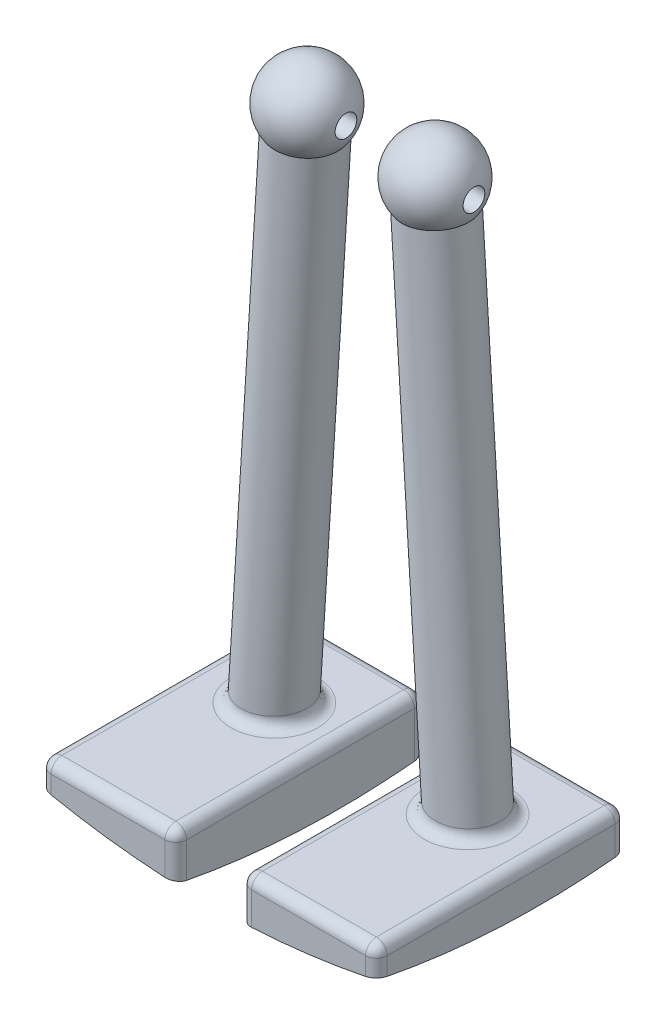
ISO-10303-21;
HEADER;
FILE_DESCRIPTION(('STEP AP214'),'2;1');
FILE_NAME('part.step','',(''),(''),'','','');
FILE_SCHEMA(('AUTOMOTIVE_DESIGN { 1 0 10303 214 1 1 1 1 }'));
ENDSEC;
DATA;
#1=APPLICATION_CONTEXT('core data for automotive mechanical design processes');
#2=APPLICATION_PROTOCOL_DEFINITION('international standard','automotive_design',2000,#1);
#3=PRODUCT_CONTEXT('',#1,'mechanical');
#4=PRODUCT('Part','Part','',(#3));
#5=PRODUCT_RELATED_PRODUCT_CATEGORY('part','',(#4));
#6=PRODUCT_DEFINITION_FORMATION('','',#4);
#7=PRODUCT_DEFINITION_CONTEXT('part definition',#1,'design');
#8=PRODUCT_DEFINITION('design','',#6,#7);
#9=PRODUCT_DEFINITION_SHAPE('','',#8);
#10=(LENGTH_UNIT() NAMED_UNIT(*) SI_UNIT(.MILLI.,.METRE.));
#11=(NAMED_UNIT(*) PLANE_ANGLE_UNIT() SI_UNIT($,.RADIAN.));
#12=(NAMED_UNIT(*) SI_UNIT($,.STERADIAN.) SOLID_ANGLE_UNIT());
#13=UNCERTAINTY_MEASURE_WITH_UNIT(LENGTH_MEASURE(1.E-05),#10,'distance_accuracy_value','');
#14=(GEOMETRIC_REPRESENTATION_CONTEXT(3) GLOBAL_UNCERTAINTY_ASSIGNED_CONTEXT((#13)) GLOBAL_UNIT_ASSIGNED_CONTEXT((#10,
#11,#12)) REPRESENTATION_CONTEXT('',''));
#15=CARTESIAN_POINT('',(0.,0.,0.));
#16=DIRECTION('',(0.,0.,1.));
#17=DIRECTION('',(1.,0.,0.));
#18=AXIS2_PLACEMENT_3D('',#15,#16,#17);
#19=CARTESIAN_POINT('',(-7.49527454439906,-25.4,0.));
#20=DIRECTION('',(-0.0620045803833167,-0.998075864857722,0.));
#21=DIRECTION('',(-0.998075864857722,0.0620045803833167,0.));
#22=AXIS2_PLACEMENT_3D('',#19,#20,#21);
#23=SPHERICAL_SURFACE('',#22,4.74114179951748);
#24=CARTESIAN_POINT('',(-12.0631543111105,-25.4,0.));
#25=DIRECTION('',(-1.,0.,0.));
#26=DIRECTION('',(0.,0.,1.));
#27=AXIS2_PLACEMENT_3D('',#24,#25,#26);
#28=CIRCLE('',#27,1.27);
#29=CARTESIAN_POINT('',(-12.0631543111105,-25.4,1.27));
#30=VERTEX_POINT('',#29);
#31=EDGE_CURVE('E311',#30,#30,#28,.T.);
#32=ORIENTED_EDGE('',*,*,#31,.F.);
#33=EDGE_LOOP('',(#32));
#34=FACE_BOUND('',#33,.T.);
#35=CARTESIAN_POINT('',(-7.67023654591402,-28.2163298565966,0.));
#36=DIRECTION('',(0.0620045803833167,0.998075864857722,0.));
#37=DIRECTION('',(-0.998075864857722,0.0620045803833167,0.));
#38=AXIS2_PLACEMENT_3D('',#35,#36,#37);
#39=CIRCLE('',#38,3.81);
#40=CARTESIAN_POINT('',(-11.4729055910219,-27.9800924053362,0.));
#41=VERTEX_POINT('',#40);
#42=EDGE_CURVE('E213',#41,#41,#39,.T.);
#43=ORIENTED_EDGE('',*,*,#42,.T.);
#44=EDGE_LOOP('',(#43));
#45=FACE_BOUND('',#44,.T.);
#46=CARTESIAN_POINT('',(-2.92739477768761,-25.4,0.));
#47=DIRECTION('',(1.,0.,0.));
#48=DIRECTION('',(0.,0.,-1.));
#49=AXIS2_PLACEMENT_3D('',#46,#47,#48);
#50=CIRCLE('',#49,1.27);
#51=CARTESIAN_POINT('',(-2.92739477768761,-25.4,1.27));
#52=VERTEX_POINT('',#51);
#53=EDGE_CURVE('E46',#52,#52,#50,.T.);
#54=ORIENTED_EDGE('',*,*,#53,.F.);
#55=EDGE_LOOP('',(#54));
#56=FACE_BOUND('',#55,.T.);
#57=ADVANCED_FACE('F41',(#34,#45,#56),#23,.T.);
#58=CARTESIAN_POINT('',(0.,0.,0.));
#59=DIRECTION('',(-1.,0.,0.));
#60=DIRECTION('',(0.,-1.,0.));
#61=AXIS2_PLACEMENT_3D('',#58,#59,#60);
#62=SPHERICAL_SURFACE('',#61,95.25);
#63=CARTESIAN_POINT('',(0.,0.,-10.16));
#64=DIRECTION('',(0.,0.,-1.));
#65=DIRECTION('',(-1.,0.,0.));
#66=AXIS2_PLACEMENT_3D('',#63,#64,#65);
#67=CIRCLE('',#66,94.706583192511);
#68=CARTESIAN_POINT('',(-5.08,-94.5702410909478,-10.16));
#69=VERTEX_POINT('',#68);
#70=CARTESIAN_POINT('',(-18.415,-92.8990025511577,-10.16));
#71=VERTEX_POINT('',#70);
#72=EDGE_CURVE('E209',#69,#71,#67,.T.);
#73=ORIENTED_EDGE('',*,*,#72,.F.);
#74=CARTESIAN_POINT('',(-3.81,-94.7576609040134,-8.89));
#75=CARTESIAN_POINT('',(-3.8100002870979,-94.7542891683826,-8.92593884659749));
#76=CARTESIAN_POINT('',(-3.8115264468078,-94.7508378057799,-8.96185257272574));
#77=CARTESIAN_POINT('',(-3.8176113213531,-94.7437977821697,-9.03340625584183));
#78=CARTESIAN_POINT('',(-3.82216983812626,-94.7402091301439,-9.0690462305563));
#79=CARTESIAN_POINT('',(-3.84034488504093,-94.7292818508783,-9.17510736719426));
#80=CARTESIAN_POINT('',(-3.85846105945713,-94.7217703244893,-9.24479304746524));
#81=CARTESIAN_POINT('',(-3.90617093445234,-94.7065130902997,-9.38008097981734));
#82=CARTESIAN_POINT('',(-3.93576920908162,-94.6987672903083,-9.44568159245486));
#83=CARTESIAN_POINT('',(-4.00559731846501,-94.6832601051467,-9.57095316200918));
#84=CARTESIAN_POINT('',(-4.04582558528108,-94.6754987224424,-9.63062499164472));
#85=CARTESIAN_POINT('',(-4.13584514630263,-94.6601691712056,-9.74242658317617));
#86=CARTESIAN_POINT('',(-4.18565006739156,-94.6526012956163,-9.79454541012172));
#87=CARTESIAN_POINT('',(-4.29339622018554,-94.6378841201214,-9.88965904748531));
#88=CARTESIAN_POINT('',(-4.35133913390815,-94.6307349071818,-9.93265196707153));
#89=CARTESIAN_POINT('',(-4.47362130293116,-94.6170724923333,-10.0081972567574));
#90=CARTESIAN_POINT('',(-4.5379515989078,-94.6105584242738,-10.0407639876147));
#91=CARTESIAN_POINT('',(-4.67123881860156,-94.5983458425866,-10.0945621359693));
#92=CARTESIAN_POINT('',(-4.74019242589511,-94.5926467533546,-10.1158015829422));
#93=CARTESIAN_POINT('',(-4.85468762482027,-94.5841597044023,-10.1406759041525));
#94=CARTESIAN_POINT('',(-4.89945588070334,-94.5810746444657,-10.1479165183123));
#95=CARTESIAN_POINT('',(-4.9894718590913,-94.5753315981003,-10.1575774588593));
#96=CARTESIAN_POINT('',(-5.03471881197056,-94.5726730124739,-10.1600046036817));
#97=CARTESIAN_POINT('',(-5.08,-94.5702410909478,-10.16));
#98=B_SPLINE_CURVE_WITH_KNOTS('',3,(#74,#75,#76,#77,#78,#79,#80,#81,#82,#83,#84,#85,#86,#87,#88,
#89,#90,#91,#92,#93,#94,#95,#96,#97),.UNSPECIFIED.,.F.,.F.,(4,2,2,2,2,2,2,2,2,2,2,4),(0.,
0.108222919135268,0.216438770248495,0.432503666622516,0.648654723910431,0.864773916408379,
1.08120293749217,1.2976767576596,1.51385111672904,1.72987203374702,1.86599625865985,
2.00192752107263),.UNSPECIFIED.);
#99=CARTESIAN_POINT('',(-3.80999999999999,-94.7576609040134,-8.89));
#100=VERTEX_POINT('',#99);
#101=EDGE_CURVE('E154',#100,#69,#98,.T.);
#102=ORIENTED_EDGE('',*,*,#101,.F.);
#103=CARTESIAN_POINT('',(-3.80999999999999,0.,0.));
#104=DIRECTION('',(1.,0.,0.));
#105=DIRECTION('',(0.,0.,-1.));
#106=AXIS2_PLACEMENT_3D('',#103,#104,#105);
#107=CIRCLE('',#106,95.1737694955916);
#108=CARTESIAN_POINT('',(-3.80999999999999,-93.4982245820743,17.78));
#109=VERTEX_POINT('',#108);
#110=EDGE_CURVE('E147',#109,#100,#107,.T.);
#111=ORIENTED_EDGE('',*,*,#110,.F.);
#112=CARTESIAN_POINT('',(-5.08,-93.1871965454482,19.05));
#113=CARTESIAN_POINT('',(-5.04442358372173,-93.1891359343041,19.0500000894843));
#114=CARTESIAN_POINT('',(-5.00888050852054,-93.1913588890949,19.0485041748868));
#115=CARTESIAN_POINT('',(-4.93808726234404,-93.1963544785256,19.0425464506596));
#116=CARTESIAN_POINT('',(-4.9028370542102,-93.1991270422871,19.038085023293));
#117=CARTESIAN_POINT('',(-4.79801603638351,-93.2082295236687,19.0203189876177));
#118=CARTESIAN_POINT('',(-4.72920519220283,-93.2153535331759,19.0026323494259));
#119=CARTESIAN_POINT('',(-4.59571152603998,-93.2314901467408,18.9561664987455));
#120=CARTESIAN_POINT('',(-4.53102908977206,-93.240502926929,18.9273862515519));
#121=CARTESIAN_POINT('',(-4.4075049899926,-93.2601503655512,18.8596344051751));
#122=CARTESIAN_POINT('',(-4.34866366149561,-93.2707851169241,18.8206622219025));
#123=CARTESIAN_POINT('',(-4.23767544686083,-93.2935141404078,18.7331261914));
#124=CARTESIAN_POINT('',(-4.18562398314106,-93.3056253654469,18.6844458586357));
#125=CARTESIAN_POINT('',(-4.09046487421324,-93.3308542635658,18.5792204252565));
#126=CARTESIAN_POINT('',(-4.04735950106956,-93.3439721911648,18.522673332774));
#127=CARTESIAN_POINT('',(-3.9705287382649,-93.3710915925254,18.4022291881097));
#128=CARTESIAN_POINT('',(-3.9369867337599,-93.3851047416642,18.3382178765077));
#129=CARTESIAN_POINT('',(-3.88124382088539,-93.4134000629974,18.2055076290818));
#130=CARTESIAN_POINT('',(-3.85903706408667,-93.4276820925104,18.1368111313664));
#131=CARTESIAN_POINT('',(-3.83190716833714,-93.4514256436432,18.0197795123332));
#132=CARTESIAN_POINT('',(-3.82370075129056,-93.4609260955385,17.9721873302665));
#133=CARTESIAN_POINT('',(-3.81274818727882,-93.4797396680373,17.876412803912));
#134=CARTESIAN_POINT('',(-3.80999440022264,-93.4890530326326,17.8282313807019));
#135=CARTESIAN_POINT('',(-3.81,-93.4982245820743,17.78));
#136=B_SPLINE_CURVE_WITH_KNOTS('',3,(#112,#113,#114,#115,#116,#117,#118,#119,#120,#121,#122,
#123,#124,#125,#126,#127,#128,#129,#130,#131,#132,#133,#134,#135),.UNSPECIFIED.,.F.,.F.,(4,2,2,
2,2,2,2,2,2,2,2,4),(0.,0.106820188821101,0.21362661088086,0.426736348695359,0.639865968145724,
0.853007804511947,1.06888027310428,1.28480750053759,1.5046328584,1.7243446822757,
1.8717178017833,2.01888427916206),.UNSPECIFIED.);
#137=CARTESIAN_POINT('',(-5.08,-93.1871965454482,19.05));
#138=VERTEX_POINT('',#137);
#139=EDGE_CURVE('E159',#138,#109,#136,.T.);
#140=ORIENTED_EDGE('',*,*,#139,.F.);
#141=CARTESIAN_POINT('',(0.,0.,19.05));
#142=DIRECTION('',(0.,0.,-1.));
#143=DIRECTION('',(-1.,0.,0.));
#144=AXIS2_PLACEMENT_3D('',#141,#142,#143);
#145=CIRCLE('',#144,93.3255592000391);
#146=CARTESIAN_POINT('',(-18.415,-91.4906977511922,19.05));
#147=VERTEX_POINT('',#146);
#148=EDGE_CURVE('E152',#138,#147,#145,.T.);
#149=ORIENTED_EDGE('',*,*,#148,.T.);
#150=CARTESIAN_POINT('',(-19.685,-91.4818827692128,17.78));
#151=CARTESIAN_POINT('',(-19.6849996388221,-91.475129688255,17.8147464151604));
#152=CARTESIAN_POINT('',(-19.6835730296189,-91.4686553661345,17.8495318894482));
#153=CARTESIAN_POINT('',(-19.6778542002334,-91.4563067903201,17.9189775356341));
#154=CARTESIAN_POINT('',(-19.6735616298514,-91.4504326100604,17.9536376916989));
#155=CARTESIAN_POINT('',(-19.656373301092,-91.4337837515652,18.0570671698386));
#156=CARTESIAN_POINT('',(-19.6391669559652,-91.4239738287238,18.1253313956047));
#157=CARTESIAN_POINT('',(-19.5935356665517,-91.4072743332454,18.2584526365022));
#158=CARTESIAN_POINT('',(-19.5650961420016,-91.4003885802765,18.3233050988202));
#159=CARTESIAN_POINT('',(-19.4977089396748,-91.3897947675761,18.4475547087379));
#160=CARTESIAN_POINT('',(-19.4587674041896,-91.386084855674,18.5069550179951));
#161=CARTESIAN_POINT('',(-19.3723412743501,-91.3820147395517,18.6173870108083));
#162=CARTESIAN_POINT('',(-19.3250429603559,-91.3815890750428,18.6685622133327));
#163=CARTESIAN_POINT('',(-19.2227577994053,-91.3839298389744,18.7624697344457));
#164=CARTESIAN_POINT('',(-19.167770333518,-91.3866965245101,18.8052013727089));
#165=CARTESIAN_POINT('',(-19.0522511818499,-91.3952858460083,18.8806962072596));
#166=CARTESIAN_POINT('',(-18.9917723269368,-91.4010814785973,18.9135435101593));
#167=CARTESIAN_POINT('',(-18.8665899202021,-91.4155193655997,18.9689704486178));
#168=CARTESIAN_POINT('',(-18.801886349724,-91.4241616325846,18.9915500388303));
#169=CARTESIAN_POINT('',(-18.6833833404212,-91.4420080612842,19.0225095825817));
#170=CARTESIAN_POINT('',(-18.6300101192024,-91.450749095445,19.0328327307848));
#171=CARTESIAN_POINT('',(-18.5227159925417,-91.4696793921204,19.0465814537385));
#172=CARTESIAN_POINT('',(-18.4687960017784,-91.4798665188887,19.0500170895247));
#173=CARTESIAN_POINT('',(-18.415,-91.4906977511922,19.05));
#174=B_SPLINE_CURVE_WITH_KNOTS('',3,(#150,#151,#152,#153,#154,#155,#156,#157,#158,#159,#160,
#161,#162,#163,#164,#165,#166,#167,#168,#169,#170,#171,#172,#173),.UNSPECIFIED.,.F.,.F.,(4,2,2,
2,2,2,2,2,2,2,2,4),(0.,0.106129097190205,0.212271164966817,0.42441677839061,0.636838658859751,
0.849136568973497,1.05719182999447,1.26526384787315,1.47151175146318,1.67776056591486,
1.84250073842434,2.00700008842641),.UNSPECIFIED.);
#175=CARTESIAN_POINT('',(-19.685,-91.4818827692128,17.78));
#176=VERTEX_POINT('',#175);
#177=EDGE_CURVE('E130',#176,#147,#174,.T.);
#178=ORIENTED_EDGE('',*,*,#177,.F.);
#179=CARTESIAN_POINT('',(-19.685,0.,0.));
#180=DIRECTION('',(1.,0.,0.));
#181=DIRECTION('',(0.,0.,-1.));
#182=AXIS2_PLACEMENT_3D('',#179,#180,#181);
#183=CIRCLE('',#182,93.1936868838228);
#184=CARTESIAN_POINT('',(-19.685,-92.7686971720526,-8.89));
#185=VERTEX_POINT('',#184);
#186=EDGE_CURVE('E141',#176,#185,#183,.T.);
#187=ORIENTED_EDGE('',*,*,#186,.T.);
#188=CARTESIAN_POINT('',(-18.415,-92.8990025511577,-10.16));
#189=CARTESIAN_POINT('',(-18.4506505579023,-92.8919357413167,-10.1599994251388));
#190=CARTESIAN_POINT('',(-18.48631245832,-92.885009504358,-10.1584978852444));
#191=CARTESIAN_POINT('',(-18.5574463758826,-92.8714806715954,-10.1524914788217));
#192=CARTESIAN_POINT('',(-18.5929183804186,-92.8648780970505,-10.1479864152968));
#193=CARTESIAN_POINT('',(-18.6986725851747,-92.8456302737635,-10.1299728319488));
#194=CARTESIAN_POINT('',(-18.7683451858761,-92.8335345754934,-10.1119659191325));
#195=CARTESIAN_POINT('',(-18.9039542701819,-92.8111954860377,-10.0643086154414));
#196=CARTESIAN_POINT('',(-18.9698868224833,-92.8009540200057,-10.0346462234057));
#197=CARTESIAN_POINT('',(-19.0959759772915,-92.7826593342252,-9.96441735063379));
#198=CARTESIAN_POINT('',(-19.1561354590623,-92.7746050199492,-9.92385634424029));
#199=CARTESIAN_POINT('',(-19.2678809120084,-92.7610629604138,-9.83369599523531));
#200=CARTESIAN_POINT('',(-19.3195948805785,-92.7555340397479,-9.78426144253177));
#201=CARTESIAN_POINT('',(-19.4140917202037,-92.7470265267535,-9.67727872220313));
#202=CARTESIAN_POINT('',(-19.4568737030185,-92.7440481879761,-9.61972974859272));
#203=CARTESIAN_POINT('',(-19.5314868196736,-92.7407740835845,-9.49933017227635));
#204=CARTESIAN_POINT('',(-19.5635046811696,-92.740430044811,-9.43659637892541));
#205=CARTESIAN_POINT('',(-19.6167235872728,-92.7423100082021,-9.30674524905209));
#206=CARTESIAN_POINT('',(-19.6379300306,-92.7445327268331,-9.23963011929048));
#207=CARTESIAN_POINT('',(-19.6639493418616,-92.7503435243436,-9.125109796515));
#208=CARTESIAN_POINT('',(-19.6718454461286,-92.753258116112,-9.07834526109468));
#209=CARTESIAN_POINT('',(-19.6823710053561,-92.7601746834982,-8.98437597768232));
#210=CARTESIAN_POINT('',(-19.6850081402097,-92.7641750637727,-8.93717197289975));
#211=CARTESIAN_POINT('',(-19.685,-92.7686971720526,-8.89));
#212=B_SPLINE_CURVE_WITH_KNOTS('',3,(#188,#189,#190,#191,#192,#193,#194,#195,#196,#197,#198,
#199,#200,#201,#202,#203,#204,#205,#206,#207,#208,#209,#210,#211),.UNSPECIFIED.,.F.,.F.,(4,2,2,
2,2,2,2,2,2,2,2,4),(0.,0.108968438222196,0.217944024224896,0.435737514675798,0.653755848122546,
0.871664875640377,1.08588166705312,1.3001197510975,1.51042233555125,1.72061980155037,
1.86287984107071,2.00493197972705),.UNSPECIFIED.);
#213=EDGE_CURVE('E153',#71,#185,#212,.T.);
#214=ORIENTED_EDGE('',*,*,#213,.F.);
#215=EDGE_LOOP('',(#73,#102,#111,#140,#149,#178,#187,#214));
#216=FACE_BOUND('',#215,.T.);
#217=ADVANCED_FACE('F43',(#216),#62,.T.);
#218=CARTESIAN_POINT('',(-19.685,-88.1136868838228,0.));
#219=DIRECTION('',(1.,0.,0.));
#220=DIRECTION('',(0.,0.,1.));
#221=AXIS2_PLACEMENT_3D('',#218,#219,#220);
#222=PLANE('',#221);
#223=ORIENTED_EDGE('',*,*,#186,.F.);
#224=DIRECTION('',(0.,1.,0.));
#225=VECTOR('',#224,1.);
#226=CARTESIAN_POINT('',(-19.685,-91.2258777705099,17.78));
#227=LINE('',#226,#225);
#228=CARTESIAN_POINT('',(-19.685,-89.3836868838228,17.78));
#229=VERTEX_POINT('',#228);
#230=EDGE_CURVE('E125',#229,#176,#227,.F.);
#231=ORIENTED_EDGE('',*,*,#230,.F.);
#232=DIRECTION('',(0.,0.,-1.));
#233=VECTOR('',#232,1.);
#234=CARTESIAN_POINT('',(-19.685,-89.3836868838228,19.05));
#235=LINE('',#234,#233);
#236=CARTESIAN_POINT('',(-19.685,-89.3836868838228,-8.89));
#237=VERTEX_POINT('',#236);
#238=EDGE_CURVE('E138',#237,#229,#235,.F.);
#239=ORIENTED_EDGE('',*,*,#238,.F.);
#240=DIRECTION('',(0.,1.,0.));
#241=VECTOR('',#240,1.);
#242=CARTESIAN_POINT('',(-19.685,-88.1136868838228,-8.89));
#243=LINE('',#242,#241);
#244=EDGE_CURVE('E137',#185,#237,#243,.T.);
#245=ORIENTED_EDGE('',*,*,#244,.F.);
#246=EDGE_LOOP('',(#223,#231,#239,#245));
#247=FACE_BOUND('',#246,.T.);
#248=ADVANCED_FACE('F142',(#247),#222,.F.);
#249=CARTESIAN_POINT('',(-3.81,-95.1737694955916,0.));
#250=DIRECTION('',(-1.,0.,0.));
#251=DIRECTION('',(0.,0.,-1.));
#252=AXIS2_PLACEMENT_3D('',#249,#250,#251);
#253=PLANE('',#252);
#254=DIRECTION('',(0.,0.,1.));
#255=VECTOR('',#254,1.);
#256=CARTESIAN_POINT('',(-3.81,-89.3836868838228,-10.16));
#257=LINE('',#256,#255);
#258=CARTESIAN_POINT('',(-3.81,-89.3836868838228,17.78));
#259=VERTEX_POINT('',#258);
#260=CARTESIAN_POINT('',(-3.81,-89.3836868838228,-8.89));
#261=VERTEX_POINT('',#260);
#262=EDGE_CURVE('E309',#259,#261,#257,.F.);
#263=ORIENTED_EDGE('',*,*,#262,.F.);
#264=DIRECTION('',(0.,-1.,0.));
#265=VECTOR('',#264,1.);
#266=CARTESIAN_POINT('',(-3.81,-88.1136868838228,17.78));
#267=LINE('',#266,#265);
#268=EDGE_CURVE('E287',#109,#259,#267,.F.);
#269=ORIENTED_EDGE('',*,*,#268,.F.);
#270=ORIENTED_EDGE('',*,*,#110,.T.);
#271=DIRECTION('',(0.,-1.,0.));
#272=VECTOR('',#271,1.);
#273=CARTESIAN_POINT('',(-3.81,-95.1737694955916,-8.89));
#274=LINE('',#273,#272);
#275=EDGE_CURVE('E51',#261,#100,#274,.T.);
#276=ORIENTED_EDGE('',*,*,#275,.F.);
#277=EDGE_LOOP('',(#263,#269,#270,#276));
#278=FACE_BOUND('',#277,.T.);
#279=ADVANCED_FACE('F257',(#278),#253,.F.);
#280=CARTESIAN_POINT('',(-68.8747113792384,-88.1136868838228,-100.115350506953));
#281=DIRECTION('',(0.,1.,0.));
#282=DIRECTION('',(0.,0.,1.));
#283=AXIS2_PLACEMENT_3D('',#280,#281,#282);
#284=PLANE('',#283);
#285=DIRECTION('',(-1.,0.,0.));
#286=VECTOR('',#285,1.);
#287=CARTESIAN_POINT('',(-68.8747113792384,-88.1136868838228,17.78));
#288=LINE('',#287,#286);
#289=CARTESIAN_POINT('',(-5.08,-88.1136868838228,17.78));
#290=VERTEX_POINT('',#289);
#291=CARTESIAN_POINT('',(-18.415,-88.1136868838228,17.78));
#292=VERTEX_POINT('',#291);
#293=EDGE_CURVE('E297',#290,#292,#288,.T.);
#294=ORIENTED_EDGE('',*,*,#293,.F.);
#295=DIRECTION('',(0.,0.,1.));
#296=VECTOR('',#295,1.);
#297=CARTESIAN_POINT('',(-5.08,-88.1136868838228,19.05));
#298=LINE('',#297,#296);
#299=CARTESIAN_POINT('',(-5.08,-88.1136868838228,-8.89));
#300=VERTEX_POINT('',#299);
#301=EDGE_CURVE('E300',#300,#290,#298,.T.);
#302=ORIENTED_EDGE('',*,*,#301,.F.);
#303=DIRECTION('',(-1.,0.,0.));
#304=VECTOR('',#303,1.);
#305=CARTESIAN_POINT('',(-3.81,-88.1136868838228,-8.89));
#306=LINE('',#305,#304);
#307=CARTESIAN_POINT('',(-18.415,-88.1136868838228,-8.89));
#308=VERTEX_POINT('',#307);
#309=EDGE_CURVE('E302',#308,#300,#306,.F.);
#310=ORIENTED_EDGE('',*,*,#309,.F.);
#311=DIRECTION('',(0.,0.,-1.));
#312=VECTOR('',#311,1.);
#313=CARTESIAN_POINT('',(-18.415,-88.1136868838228,-10.16));
#314=LINE('',#313,#312);
#315=EDGE_CURVE('E305',#292,#308,#314,.T.);
#316=ORIENTED_EDGE('',*,*,#315,.F.);
#317=EDGE_LOOP('',(#294,#302,#310,#316));
#318=FACE_BOUND('',#317,.T.);
#319=CARTESIAN_POINT('',(-11.312409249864,-88.1136868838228,0.));
#320=DIRECTION('',(0.,-1.,0.));
#321=DIRECTION('',(-1.,0.,0.));
#322=AXIS2_PLACEMENT_3D('',#319,#320,#321);
#323=ELLIPSE('',#322,5.08979345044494,5.08);
#324=CARTESIAN_POINT('',(-16.4022027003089,-88.1136868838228,0.));
#325=VERTEX_POINT('',#324);
#326=EDGE_CURVE('E294',#325,#325,#323,.F.);
#327=ORIENTED_EDGE('',*,*,#326,.F.);
#328=EDGE_LOOP('',(#327));
#329=FACE_BOUND('',#328,.T.);
#330=ADVANCED_FACE('F251',(#318,#329),#284,.T.);
#331=CARTESIAN_POINT('',(5.23518055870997,-100.195539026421,-10.16));
#332=DIRECTION('',(0.,0.,1.));
#333=DIRECTION('',(-1.,0.,0.));
#334=AXIS2_PLACEMENT_3D('',#331,#332,#333);
#335=PLANE('',#334);
#336=DIRECTION('',(-1.,0.,0.));
#337=VECTOR('',#336,1.);
#338=CARTESIAN_POINT('',(-19.685,-89.3836868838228,-10.16));
#339=LINE('',#338,#337);
#340=CARTESIAN_POINT('',(-5.08,-89.3836868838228,-10.16));
#341=VERTEX_POINT('',#340);
#342=CARTESIAN_POINT('',(-18.415,-89.3836868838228,-10.16));
#343=VERTEX_POINT('',#342);
#344=EDGE_CURVE('E200',#341,#343,#339,.T.);
#345=ORIENTED_EDGE('',*,*,#344,.F.);
#346=DIRECTION('',(0.,-1.,0.));
#347=VECTOR('',#346,1.);
#348=CARTESIAN_POINT('',(-5.08,-100.195539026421,-10.16));
#349=LINE('',#348,#347);
#350=EDGE_CURVE('E203',#69,#341,#349,.F.);
#351=ORIENTED_EDGE('',*,*,#350,.F.);
#352=ORIENTED_EDGE('',*,*,#72,.T.);
#353=DIRECTION('',(0.,1.,0.));
#354=VECTOR('',#353,1.);
#355=CARTESIAN_POINT('',(-18.415,-100.195539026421,-10.16));
#356=LINE('',#355,#354);
#357=EDGE_CURVE('E198',#343,#71,#356,.F.);
#358=ORIENTED_EDGE('',*,*,#357,.F.);
#359=EDGE_LOOP('',(#345,#351,#352,#358));
#360=FACE_BOUND('',#359,.T.);
#361=ADVANCED_FACE('F256',(#360),#335,.F.);
#362=CARTESIAN_POINT('',(7.75824142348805,-99.8983781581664,19.05));
#363=DIRECTION('',(0.,0.,1.));
#364=DIRECTION('',(-1.,0.,0.));
#365=AXIS2_PLACEMENT_3D('',#362,#363,#364);
#366=PLANE('',#365);
#367=ORIENTED_EDGE('',*,*,#148,.F.);
#368=DIRECTION('',(0.,-1.,0.));
#369=VECTOR('',#368,1.);
#370=CARTESIAN_POINT('',(-5.08,-93.2477554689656,19.05));
#371=LINE('',#370,#369);
#372=CARTESIAN_POINT('',(-5.08,-89.3836868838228,19.05));
#373=VERTEX_POINT('',#372);
#374=EDGE_CURVE('E156',#373,#138,#371,.T.);
#375=ORIENTED_EDGE('',*,*,#374,.F.);
#376=DIRECTION('',(-1.,0.,0.));
#377=VECTOR('',#376,1.);
#378=CARTESIAN_POINT('',(7.75824142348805,-89.3836868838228,19.05));
#379=LINE('',#378,#377);
#380=CARTESIAN_POINT('',(-18.415,-89.3836868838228,19.05));
#381=VERTEX_POINT('',#380);
#382=EDGE_CURVE('E290',#381,#373,#379,.F.);
#383=ORIENTED_EDGE('',*,*,#382,.F.);
#384=DIRECTION('',(0.,1.,0.));
#385=VECTOR('',#384,1.);
#386=CARTESIAN_POINT('',(-18.415,-88.1136868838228,19.05));
#387=LINE('',#386,#385);
#388=EDGE_CURVE('E283',#147,#381,#387,.T.);
#389=ORIENTED_EDGE('',*,*,#388,.F.);
#390=EDGE_LOOP('',(#367,#375,#383,#389));
#391=FACE_BOUND('',#390,.T.);
#392=ADVANCED_FACE('F272',(#391),#366,.T.);
#393=CARTESIAN_POINT('',(-11.4059829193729,-88.3499243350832,0.));
#394=DIRECTION('',(-0.0620045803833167,-0.998075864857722,0.));
#395=DIRECTION('',(-0.998075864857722,0.0620045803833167,0.));
#396=AXIS2_PLACEMENT_3D('',#393,#394,#395);
#397=CYLINDRICAL_SURFACE('',#396,3.81);
#398=CARTESIAN_POINT('',(-11.312409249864,-86.8436868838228,0.));
#399=DIRECTION('',(-0.0205976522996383,0.999787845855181,0.));
#400=DIRECTION('',(-0.999787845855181,-0.0205976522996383,0.));
#401=AXIS2_PLACEMENT_3D('',#398,#399,#400);
#402=ELLIPSE('',#401,3.82304817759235,3.81);
#403=CARTESIAN_POINT('',(-15.1346463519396,-86.9224327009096,0.));
#404=VERTEX_POINT('',#403);
#405=EDGE_CURVE('E12',#404,#404,#402,.F.);
#406=ORIENTED_EDGE('',*,*,#405,.F.);
#407=EDGE_LOOP('',(#406));
#408=FACE_BOUND('',#407,.T.);
#409=ORIENTED_EDGE('',*,*,#42,.F.);
#410=EDGE_LOOP('',(#409));
#411=FACE_BOUND('',#410,.T.);
#412=ADVANCED_FACE('F189',(#408,#411),#397,.T.);
#413=CARTESIAN_POINT('',(-5.08,-99.8983781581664,17.78));
#414=DIRECTION('',(0.,1.,0.));
#415=DIRECTION('',(0.,0.,1.));
#416=AXIS2_PLACEMENT_3D('',#413,#414,#415);
#417=CYLINDRICAL_SURFACE('',#416,1.27);
#418=CARTESIAN_POINT('',(-5.08,-89.3836868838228,17.78));
#419=DIRECTION('',(0.,-1.,0.));
#420=DIRECTION('',(0.,0.,1.));
#421=AXIS2_PLACEMENT_3D('',#418,#419,#420);
#422=CIRCLE('',#421,1.27);
#423=EDGE_CURVE('E216',#259,#373,#422,.T.);
#424=ORIENTED_EDGE('',*,*,#423,.T.);
#425=ORIENTED_EDGE('',*,*,#374,.T.);
#426=ORIENTED_EDGE('',*,*,#139,.T.);
#427=ORIENTED_EDGE('',*,*,#268,.T.);
#428=EDGE_LOOP('',(#424,#425,#426,#427));
#429=FACE_BOUND('',#428,.T.);
#430=ADVANCED_FACE('F184',(#429),#417,.T.);
#431=CARTESIAN_POINT('',(-5.08,-89.3836868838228,17.78));
#432=DIRECTION('',(0.,0.,1.));
#433=DIRECTION('',(-1.,0.,0.));
#434=AXIS2_PLACEMENT_3D('',#431,#432,#433);
#435=SPHERICAL_SURFACE('',#434,1.27);
#436=CARTESIAN_POINT('',(-5.08,-89.3836868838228,17.78));
#437=DIRECTION('',(0.,0.,-1.));
#438=DIRECTION('',(-1.,0.,0.));
#439=AXIS2_PLACEMENT_3D('',#436,#437,#438);
#440=CIRCLE('',#439,1.27);
#441=EDGE_CURVE('E67',#259,#290,#440,.F.);
#442=ORIENTED_EDGE('',*,*,#441,.T.);
#443=CARTESIAN_POINT('',(-5.08,-89.3836868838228,17.78));
#444=DIRECTION('',(-1.,0.,0.));
#445=DIRECTION('',(0.,-1.,0.));
#446=AXIS2_PLACEMENT_3D('',#443,#444,#445);
#447=CIRCLE('',#446,1.27);
#448=EDGE_CURVE('E219',#290,#373,#447,.F.);
#449=ORIENTED_EDGE('',*,*,#448,.T.);
#450=ORIENTED_EDGE('',*,*,#423,.F.);
#451=EDGE_LOOP('',(#442,#449,#450));
#452=FACE_BOUND('',#451,.T.);
#453=ADVANCED_FACE('F180',(#452),#435,.T.);
#454=CARTESIAN_POINT('',(-18.415,-99.8983781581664,17.78));
#455=DIRECTION('',(0.,-1.,0.));
#456=DIRECTION('',(0.,0.,-1.));
#457=AXIS2_PLACEMENT_3D('',#454,#455,#456);
#458=CYLINDRICAL_SURFACE('',#457,1.27);
#459=ORIENTED_EDGE('',*,*,#177,.T.);
#460=ORIENTED_EDGE('',*,*,#388,.T.);
#461=CARTESIAN_POINT('',(-18.415,-89.3836868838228,17.78));
#462=DIRECTION('',(0.,-1.,0.));
#463=DIRECTION('',(0.,0.,1.));
#464=AXIS2_PLACEMENT_3D('',#461,#462,#463);
#465=CIRCLE('',#464,1.27);
#466=EDGE_CURVE('E133',#381,#229,#465,.T.);
#467=ORIENTED_EDGE('',*,*,#466,.T.);
#468=ORIENTED_EDGE('',*,*,#230,.T.);
#469=EDGE_LOOP('',(#459,#460,#467,#468));
#470=FACE_BOUND('',#469,.T.);
#471=ADVANCED_FACE('F127',(#470),#458,.T.);
#472=CARTESIAN_POINT('',(-68.8747113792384,-89.3836868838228,17.78));
#473=DIRECTION('',(-1.,0.,0.));
#474=DIRECTION('',(0.,0.,-1.));
#475=AXIS2_PLACEMENT_3D('',#472,#473,#474);
#476=CYLINDRICAL_SURFACE('',#475,1.27);
#477=ORIENTED_EDGE('',*,*,#448,.F.);
#478=ORIENTED_EDGE('',*,*,#293,.T.);
#479=CARTESIAN_POINT('',(-18.415,-89.3836868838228,17.78));
#480=DIRECTION('',(1.,0.,0.));
#481=DIRECTION('',(0.,0.,-1.));
#482=AXIS2_PLACEMENT_3D('',#479,#480,#481);
#483=CIRCLE('',#482,1.27);
#484=EDGE_CURVE('E223',#292,#381,#483,.T.);
#485=ORIENTED_EDGE('',*,*,#484,.T.);
#486=ORIENTED_EDGE('',*,*,#382,.T.);
#487=EDGE_LOOP('',(#477,#478,#485,#486));
#488=FACE_BOUND('',#487,.T.);
#489=ADVANCED_FACE('F179',(#488),#476,.T.);
#490=CARTESIAN_POINT('',(-5.08,-89.3836868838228,-100.115350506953));
#491=DIRECTION('',(0.,0.,-1.));
#492=DIRECTION('',(1.,0.,0.));
#493=AXIS2_PLACEMENT_3D('',#490,#491,#492);
#494=CYLINDRICAL_SURFACE('',#493,1.27);
#495=ORIENTED_EDGE('',*,*,#441,.F.);
#496=ORIENTED_EDGE('',*,*,#262,.T.);
#497=CARTESIAN_POINT('',(-5.08,-89.3836868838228,-8.89));
#498=DIRECTION('',(0.,0.,1.));
#499=DIRECTION('',(1.,0.,0.));
#500=AXIS2_PLACEMENT_3D('',#497,#498,#499);
#501=CIRCLE('',#500,1.27);
#502=EDGE_CURVE('E225',#261,#300,#501,.T.);
#503=ORIENTED_EDGE('',*,*,#502,.T.);
#504=ORIENTED_EDGE('',*,*,#301,.T.);
#505=EDGE_LOOP('',(#495,#496,#503,#504));
#506=FACE_BOUND('',#505,.T.);
#507=ADVANCED_FACE('F377',(#506),#494,.T.);
#508=CARTESIAN_POINT('',(-5.08,-95.1737694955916,-8.89));
#509=DIRECTION('',(0.,-1.,0.));
#510=DIRECTION('',(0.,0.,-1.));
#511=AXIS2_PLACEMENT_3D('',#508,#509,#510);
#512=CYLINDRICAL_SURFACE('',#511,1.27);
#513=ORIENTED_EDGE('',*,*,#101,.T.);
#514=ORIENTED_EDGE('',*,*,#350,.T.);
#515=CARTESIAN_POINT('',(-5.08,-89.3836868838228,-8.89));
#516=DIRECTION('',(0.,-1.,0.));
#517=DIRECTION('',(0.,0.,1.));
#518=AXIS2_PLACEMENT_3D('',#515,#516,#517);
#519=CIRCLE('',#518,1.27);
#520=EDGE_CURVE('E59',#341,#261,#519,.T.);
#521=ORIENTED_EDGE('',*,*,#520,.T.);
#522=ORIENTED_EDGE('',*,*,#275,.T.);
#523=EDGE_LOOP('',(#513,#514,#521,#522));
#524=FACE_BOUND('',#523,.T.);
#525=ADVANCED_FACE('F369',(#524),#512,.T.);
#526=CARTESIAN_POINT('',(-18.415,-89.3836868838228,17.78));
#527=DIRECTION('',(0.,0.,1.));
#528=DIRECTION('',(-1.,0.,0.));
#529=AXIS2_PLACEMENT_3D('',#526,#527,#528);
#530=SPHERICAL_SURFACE('',#529,1.27);
#531=ORIENTED_EDGE('',*,*,#484,.F.);
#532=CARTESIAN_POINT('',(-18.415,-89.3836868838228,17.78));
#533=DIRECTION('',(0.,0.,-1.));
#534=DIRECTION('',(0.,-1.,0.));
#535=AXIS2_PLACEMENT_3D('',#532,#533,#534);
#536=CIRCLE('',#535,1.27);
#537=EDGE_CURVE('E229',#292,#229,#536,.F.);
#538=ORIENTED_EDGE('',*,*,#537,.T.);
#539=ORIENTED_EDGE('',*,*,#466,.F.);
#540=EDGE_LOOP('',(#531,#538,#539));
#541=FACE_BOUND('',#540,.T.);
#542=ADVANCED_FACE('F361',(#541),#530,.T.);
#543=CARTESIAN_POINT('',(-5.08,-89.3836868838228,-8.89));
#544=DIRECTION('',(0.,0.,1.));
#545=DIRECTION('',(-1.,0.,0.));
#546=AXIS2_PLACEMENT_3D('',#543,#544,#545);
#547=SPHERICAL_SURFACE('',#546,1.27);
#548=ORIENTED_EDGE('',*,*,#520,.F.);
#549=CARTESIAN_POINT('',(-5.08,-89.3836868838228,-8.89));
#550=DIRECTION('',(-1.,0.,0.));
#551=DIRECTION('',(0.,0.,1.));
#552=AXIS2_PLACEMENT_3D('',#549,#550,#551);
#553=CIRCLE('',#552,1.27);
#554=EDGE_CURVE('E231',#341,#300,#553,.F.);
#555=ORIENTED_EDGE('',*,*,#554,.T.);
#556=ORIENTED_EDGE('',*,*,#502,.F.);
#557=EDGE_LOOP('',(#548,#555,#556));
#558=FACE_BOUND('',#557,.T.);
#559=ADVANCED_FACE('F353',(#558),#547,.T.);
#560=CARTESIAN_POINT('',(-18.415,-89.3836868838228,-100.115350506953));
#561=DIRECTION('',(0.,0.,1.));
#562=DIRECTION('',(-1.,0.,0.));
#563=AXIS2_PLACEMENT_3D('',#560,#561,#562);
#564=CYLINDRICAL_SURFACE('',#563,1.27);
#565=ORIENTED_EDGE('',*,*,#537,.F.);
#566=ORIENTED_EDGE('',*,*,#315,.T.);
#567=CARTESIAN_POINT('',(-18.415,-89.3836868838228,-8.89));
#568=DIRECTION('',(0.,0.,1.));
#569=DIRECTION('',(1.,0.,0.));
#570=AXIS2_PLACEMENT_3D('',#567,#568,#569);
#571=CIRCLE('',#570,1.27);
#572=EDGE_CURVE('E233',#308,#237,#571,.T.);
#573=ORIENTED_EDGE('',*,*,#572,.T.);
#574=ORIENTED_EDGE('',*,*,#238,.T.);
#575=EDGE_LOOP('',(#565,#566,#573,#574));
#576=FACE_BOUND('',#575,.T.);
#577=ADVANCED_FACE('F345',(#576),#564,.T.);
#578=CARTESIAN_POINT('',(5.23518055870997,-89.3836868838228,-8.89));
#579=DIRECTION('',(1.,0.,0.));
#580=DIRECTION('',(0.,0.,1.));
#581=AXIS2_PLACEMENT_3D('',#578,#579,#580);
#582=CYLINDRICAL_SURFACE('',#581,1.27);
#583=ORIENTED_EDGE('',*,*,#554,.F.);
#584=ORIENTED_EDGE('',*,*,#344,.T.);
#585=CARTESIAN_POINT('',(-18.415,-89.3836868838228,-8.89));
#586=DIRECTION('',(1.,0.,0.));
#587=DIRECTION('',(0.,0.,-1.));
#588=AXIS2_PLACEMENT_3D('',#585,#586,#587);
#589=CIRCLE('',#588,1.27);
#590=EDGE_CURVE('E236',#343,#308,#589,.T.);
#591=ORIENTED_EDGE('',*,*,#590,.T.);
#592=ORIENTED_EDGE('',*,*,#309,.T.);
#593=EDGE_LOOP('',(#583,#584,#591,#592));
#594=FACE_BOUND('',#593,.T.);
#595=ADVANCED_FACE('F338',(#594),#582,.T.);
#596=CARTESIAN_POINT('',(-18.415,-89.3836868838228,-8.89));
#597=DIRECTION('',(0.,0.,1.));
#598=DIRECTION('',(-1.,0.,0.));
#599=AXIS2_PLACEMENT_3D('',#596,#597,#598);
#600=SPHERICAL_SURFACE('',#599,1.27);
#601=ORIENTED_EDGE('',*,*,#590,.F.);
#602=CARTESIAN_POINT('',(-18.415,-89.3836868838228,-8.89));
#603=DIRECTION('',(0.,-1.,0.));
#604=DIRECTION('',(0.,0.,1.));
#605=AXIS2_PLACEMENT_3D('',#602,#603,#604);
#606=CIRCLE('',#605,1.27);
#607=EDGE_CURVE('E238',#343,#237,#606,.F.);
#608=ORIENTED_EDGE('',*,*,#607,.T.);
#609=ORIENTED_EDGE('',*,*,#572,.F.);
#610=EDGE_LOOP('',(#601,#608,#609));
#611=FACE_BOUND('',#610,.T.);
#612=ADVANCED_FACE('F331',(#611),#600,.T.);
#613=CARTESIAN_POINT('',(-18.415,-88.1136868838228,-8.89));
#614=DIRECTION('',(0.,1.,0.));
#615=DIRECTION('',(0.,0.,1.));
#616=AXIS2_PLACEMENT_3D('',#613,#614,#615);
#617=CYLINDRICAL_SURFACE('',#616,1.27);
#618=ORIENTED_EDGE('',*,*,#213,.T.);
#619=ORIENTED_EDGE('',*,*,#244,.T.);
#620=ORIENTED_EDGE('',*,*,#607,.F.);
#621=ORIENTED_EDGE('',*,*,#357,.T.);
#622=EDGE_LOOP('',(#618,#619,#620,#621));
#623=FACE_BOUND('',#622,.T.);
#624=ADVANCED_FACE('F247',(#623),#617,.T.);
#625=CARTESIAN_POINT('',(-16.4022027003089,-88.1136868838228,0.));
#626=CARTESIAN_POINT('',(-15.2086519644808,-88.1136868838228,0.));
#627=CARTESIAN_POINT('',(-15.1346463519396,-86.9224327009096,0.));
#628=CARTESIAN_POINT('',(-16.4022027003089,-88.1136868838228,-0.221658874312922));
#629=CARTESIAN_POINT('',(-15.2086519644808,-88.1136868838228,-0.169479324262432));
#630=CARTESIAN_POINT('',(-15.1346463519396,-86.9224327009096,-0.166244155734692));
#631=CARTESIAN_POINT('',(-16.3876459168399,-88.1136868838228,-0.443317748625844));
#632=CARTESIAN_POINT('',(-15.1973040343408,-88.1136868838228,-0.338986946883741));
#633=CARTESIAN_POINT('',(-15.1237147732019,-86.9222074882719,-0.332488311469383));
#634=CARTESIAN_POINT('',(-16.3296698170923,-88.1136868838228,-0.882842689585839));
#635=CARTESIAN_POINT('',(-15.1521424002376,-88.1136868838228,-0.674890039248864));
#636=CARTESIAN_POINT('',(-15.0801769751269,-86.92131052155,-0.662132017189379));
#637=CARTESIAN_POINT('',(-16.2862486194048,-88.1136868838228,-1.10070850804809));
#638=CARTESIAN_POINT('',(-15.1183122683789,-88.1136868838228,-0.841339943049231));
#639=CARTESIAN_POINT('',(-15.0475693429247,-86.920638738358,-0.82553138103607));
#640=CARTESIAN_POINT('',(-16.1712885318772,-88.1136868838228,-1.52891994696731));
#641=CARTESIAN_POINT('',(-15.028837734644,-88.1136868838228,-1.1681377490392));
#642=CARTESIAN_POINT('',(-14.9612387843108,-86.9188601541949,-1.14668996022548));
#643=CARTESIAN_POINT('',(-16.0997461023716,-88.1136868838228,-1.7392646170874));
#644=CARTESIAN_POINT('',(-14.9731616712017,-88.1136868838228,-1.3285337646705));
#645=CARTESIAN_POINT('',(-14.907513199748,-86.9177532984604,-1.30444846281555));
#646=CARTESIAN_POINT('',(-15.9297692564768,-88.1136868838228,-2.14883550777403));
#647=CARTESIAN_POINT('',(-14.8410530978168,-88.1136868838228,-1.64035922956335));
#648=CARTESIAN_POINT('',(-14.7798671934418,-86.9151235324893,-1.61162663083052));
#649=CARTESIAN_POINT('',(-15.8313300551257,-88.1136868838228,-2.34805974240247));
#650=CARTESIAN_POINT('',(-14.7645759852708,-88.1136868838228,-1.79182680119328));
#651=CARTESIAN_POINT('',(-14.7059431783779,-86.913600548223,-1.76104480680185));
#652=CARTESIAN_POINT('',(-15.6092451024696,-88.1136868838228,-2.73198208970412));
#653=CARTESIAN_POINT('',(-14.5923055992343,-88.1136868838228,-2.0831124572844));
#654=CARTESIAN_POINT('',(-14.5391660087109,-86.9101646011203,-2.04898656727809));
#655=CARTESIAN_POINT('',(-15.4855938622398,-88.1136868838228,-2.91667702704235));
#656=CARTESIAN_POINT('',(-14.4964579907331,-88.1136868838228,-2.22295576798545));
#657=CARTESIAN_POINT('',(-14.4463087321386,-86.9082515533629,-2.18750777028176));
#658=CARTESIAN_POINT('',(-15.2152010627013,-88.1136868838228,-3.26838181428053));
#659=CARTESIAN_POINT('',(-14.2872373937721,-88.1136868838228,-2.48854344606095));
#660=CARTESIAN_POINT('',(-14.2432542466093,-86.9040682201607,-2.4512863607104));
#661=CARTESIAN_POINT('',(-15.0684539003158,-88.1136868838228,-3.4353873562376));
#662=CARTESIAN_POINT('',(-14.1738042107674,-88.1136868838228,-2.61429821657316));
#663=CARTESIAN_POINT('',(-14.1330528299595,-86.9017978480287,-2.5765405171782));
#664=CARTESIAN_POINT('',(-14.7543800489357,-88.1136868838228,-3.74885694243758));
#665=CARTESIAN_POINT('',(-13.9315145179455,-88.1136868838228,-2.84953889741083));
#666=CARTESIAN_POINT('',(-13.8971955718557,-86.896938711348,-2.81164270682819));
#667=CARTESIAN_POINT('',(-14.5870481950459,-88.1136868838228,-3.89531581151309));
#668=CARTESIAN_POINT('',(-13.8025961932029,-88.1136868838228,-2.95901957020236));
#669=CARTESIAN_POINT('',(-13.771535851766,-86.8943498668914,-2.92148685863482));
#670=CARTESIAN_POINT('',(-14.2346674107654,-88.1136868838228,-4.16518687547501));
#671=CARTESIAN_POINT('',(-13.5317041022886,-88.1136868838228,-3.15986094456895));
#672=CARTESIAN_POINT('',(-13.506911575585,-86.8888980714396,-3.12389015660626));
#673=CARTESIAN_POINT('',(-14.0496141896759,-88.1136868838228,-4.28859346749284));
#674=CARTESIAN_POINT('',(-13.3896711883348,-88.1136868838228,-3.25120110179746));
#675=CARTESIAN_POINT('',(-13.3679437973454,-86.8860350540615,-3.21644510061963));
#676=CARTESIAN_POINT('',(-13.6649559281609,-88.1136868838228,-4.51024874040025));
#677=CARTESIAN_POINT('',(-13.0951331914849,-88.1136868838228,-3.41426071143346));
#678=CARTESIAN_POINT('',(-13.0790803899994,-86.8800838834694,-3.38268655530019));
#679=CARTESIAN_POINT('',(-13.46534773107,-88.1136868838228,-4.60849194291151));
#680=CARTESIAN_POINT('',(-12.9425756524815,-88.1136868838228,-3.48594575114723));
#681=CARTESIAN_POINT('',(-12.92918239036,-86.8769956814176,-3.45636895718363));
#682=CARTESIAN_POINT('',(-13.0549936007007,-88.1136868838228,-4.77813916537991));
#683=CARTESIAN_POINT('',(-12.6297329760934,-88.1136868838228,-3.60856796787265));
#684=CARTESIAN_POINT('',(-12.6210223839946,-86.8706469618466,-3.58360437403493));
#685=CARTESIAN_POINT('',(-12.8442456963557,-88.1136868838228,-4.84953841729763));
#686=CARTESIAN_POINT('',(-12.469405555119,-88.1136868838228,-3.65945927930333));
#687=CARTESIAN_POINT('',(-12.4627588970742,-86.8673864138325,-3.63715381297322));
#688=CARTESIAN_POINT('',(-12.4152168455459,-88.1136868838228,-4.96427517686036));
#689=CARTESIAN_POINT('',(-12.14387273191,-88.1136868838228,-3.73975484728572));
#690=CARTESIAN_POINT('',(-12.1405749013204,-86.8607487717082,-3.72320638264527));
#691=CARTESIAN_POINT('',(-12.1969349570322,-88.1136868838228,-5.00760916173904));
#692=CARTESIAN_POINT('',(-11.9786379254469,-88.1136868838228,-3.76910498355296));
#693=CARTESIAN_POINT('',(-11.9766536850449,-86.8573716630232,-3.75570687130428));
#694=CARTESIAN_POINT('',(-11.7565719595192,-88.1136868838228,-5.06547250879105));
#695=CARTESIAN_POINT('',(-11.646188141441,-88.1136868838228,-3.80597239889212));
#696=CARTESIAN_POINT('',(-11.6459581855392,-86.850558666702,-3.79910438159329));
#697=CARTESIAN_POINT('',(-11.5344906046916,-88.1136868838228,-5.08));
#698=CARTESIAN_POINT('',(-11.4789584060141,-88.1136868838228,-3.81343104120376));
#699=CARTESIAN_POINT('',(-11.4791837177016,-86.8471227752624,-3.81));
#700=CARTESIAN_POINT('',(-11.0903278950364,-88.1136868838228,-5.08));
#701=CARTESIAN_POINT('',(-11.1454088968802,-88.1136868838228,-3.80655966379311));
#702=CARTESIAN_POINT('',(-11.1456347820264,-86.8402509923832,-3.81));
#703=CARTESIAN_POINT('',(-10.8682465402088,-88.1136868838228,-5.06547250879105));
#704=CARTESIAN_POINT('',(-10.9790897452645,-88.1136868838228,-3.79217049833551));
#705=CARTESIAN_POINT('',(-10.9788603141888,-86.8368151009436,-3.79910438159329));
#706=CARTESIAN_POINT('',(-10.4278835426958,-88.1136868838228,-5.00760916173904));
#707=CARTESIAN_POINT('',(-10.6501905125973,-88.1136868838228,-3.74202596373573));
#708=CARTESIAN_POINT('',(-10.6481648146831,-86.8300021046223,-3.75570687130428));
#709=CARTESIAN_POINT('',(-10.2096016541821,-88.1136868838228,-4.96427517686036));
#710=CARTESIAN_POINT('',(-10.4876261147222,-88.1136868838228,-3.70621493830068));
#711=CARTESIAN_POINT('',(-10.4842435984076,-86.8266249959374,-3.72320638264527));
#712=CARTESIAN_POINT('',(-9.78057280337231,-88.1136868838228,-4.84953841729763));
#713=CARTESIAN_POINT('',(-10.1689550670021,-88.1136868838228,-3.61400812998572));
#714=CARTESIAN_POINT('',(-10.1620596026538,-86.819987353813,-3.63715381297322));
#715=CARTESIAN_POINT('',(-9.56982489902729,-88.1136868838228,-4.77813916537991));
#716=CARTESIAN_POINT('',(-10.0128778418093,-88.1136868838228,-3.55756390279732));
#717=CARTESIAN_POINT('',(-10.0037961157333,-86.8167268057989,-3.58360437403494));
#718=CARTESIAN_POINT('',(-9.15947076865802,-88.1136868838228,-4.60849194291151));
#719=CARTESIAN_POINT('',(-9.70974511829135,-88.1136868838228,-3.42520541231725));
#720=CARTESIAN_POINT('',(-9.69563610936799,-86.810378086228,-3.45636895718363));
#721=CARTESIAN_POINT('',(-8.95986257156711,-88.1136868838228,-4.51024874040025));
#722=CARTESIAN_POINT('',(-9.56273058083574,-88.1136868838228,-3.349253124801));
#723=CARTESIAN_POINT('',(-9.54573810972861,-86.8072898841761,-3.38268655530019));
#724=CARTESIAN_POINT('',(-8.57520431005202,-88.1136868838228,-4.28859346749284));
#725=CARTESIAN_POINT('',(-9.28009428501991,-88.1136868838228,-3.17929571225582));
#726=CARTESIAN_POINT('',(-9.25687470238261,-86.801338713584,-3.21644510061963));
#727=CARTESIAN_POINT('',(-8.39015108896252,-88.1136868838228,-4.16518687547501));
#728=CARTESIAN_POINT('',(-9.14452210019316,-88.1136868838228,-3.08526547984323));
#729=CARTESIAN_POINT('',(-9.117906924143,-86.798475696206,-3.12389015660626));
#730=CARTESIAN_POINT('',(-8.0377703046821,-88.1136868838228,-3.89531581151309));
#731=CARTESIAN_POINT('',(-8.88691696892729,-88.1136868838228,-2.88083748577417));
#732=CARTESIAN_POINT('',(-8.85328264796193,-86.7930239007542,-2.92148685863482));
#733=CARTESIAN_POINT('',(-7.87043845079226,-88.1136868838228,-3.74885694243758));
#734=CARTESIAN_POINT('',(-8.76493877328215,-88.1136868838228,-2.77042917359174));
#735=CARTESIAN_POINT('',(-8.72762292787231,-86.7904350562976,-2.81164270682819));
#736=CARTESIAN_POINT('',(-7.5563645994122,-88.1136868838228,-3.4353873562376));
#737=CARTESIAN_POINT('',(-8.53641847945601,-88.1136868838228,-2.53516206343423));
#738=CARTESIAN_POINT('',(-8.49176566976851,-86.7855759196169,-2.5765405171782));
#739=CARTESIAN_POINT('',(-7.40961743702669,-88.1136868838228,-3.26838181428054));
#740=CARTESIAN_POINT('',(-8.42993259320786,-88.1136868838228,-2.41030796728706));
#741=CARTESIAN_POINT('',(-8.38156425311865,-86.7833055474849,-2.4512863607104));
#742=CARTESIAN_POINT('',(-7.13922463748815,-88.1136868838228,-2.91667702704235));
#743=CARTESIAN_POINT('',(-8.23402549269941,-88.1136868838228,-2.1482611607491));
#744=CARTESIAN_POINT('',(-8.17850976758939,-86.7791222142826,-2.18750777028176));
#745=CARTESIAN_POINT('',(-7.01557339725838,-88.1136868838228,-2.73198208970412));
#746=CARTESIAN_POINT('',(-8.14465819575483,-88.1136868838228,-2.01108812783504));
#747=CARTESIAN_POINT('',(-8.08565249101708,-86.7772091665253,-2.04898656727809));
#748=CARTESIAN_POINT('',(-6.79348844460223,-88.1136868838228,-2.34805974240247));
#749=CARTESIAN_POINT('',(-7.98433547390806,-88.1136868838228,-1.72667395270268));
#750=CARTESIAN_POINT('',(-7.91887532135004,-86.7737732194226,-1.76104480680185));
#751=CARTESIAN_POINT('',(-6.69504924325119,-88.1136868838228,-2.14883550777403));
#752=CARTESIAN_POINT('',(-7.91342811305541,-88.1136868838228,-1.57946624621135));
#753=CARTESIAN_POINT('',(-7.84495130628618,-86.7722502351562,-1.61162663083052));
#754=CARTESIAN_POINT('',(-6.52507239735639,-88.1136868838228,-1.7392646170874));
#755=CARTESIAN_POINT('',(-7.79108256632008,-88.1136868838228,-1.27737726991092));
#756=CARTESIAN_POINT('',(-7.71730529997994,-86.7696204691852,-1.30444846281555));
#757=CARTESIAN_POINT('',(-6.4535299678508,-88.1136868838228,-1.52891994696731));
#758=CARTESIAN_POINT('',(-7.73968344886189,-88.1136868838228,-1.12254112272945));
#759=CARTESIAN_POINT('',(-7.66357971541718,-86.7685136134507,-1.14668996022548));
#760=CARTESIAN_POINT('',(-6.33856988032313,-88.1136868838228,-1.1007085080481));
#761=CARTESIAN_POINT('',(-7.65711665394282,-88.1136868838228,-0.807681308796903));
#762=CARTESIAN_POINT('',(-7.57724915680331,-86.7667350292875,-0.825531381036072));
#763=CARTESIAN_POINT('',(-6.2951486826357,-88.1136868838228,-0.882842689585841));
#764=CARTESIAN_POINT('',(-7.62597651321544,-88.1136868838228,-0.647711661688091));
#765=CARTESIAN_POINT('',(-7.54464152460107,-86.7660632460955,-0.662132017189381));
#766=CARTESIAN_POINT('',(-6.23717258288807,-88.1136868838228,-0.443317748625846));
#767=CARTESIAN_POINT('',(-7.58439196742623,-88.1136868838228,-0.325131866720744));
#768=CARTESIAN_POINT('',(-7.50110372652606,-86.7651662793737,-0.332488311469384));
#769=CARTESIAN_POINT('',(-6.22261579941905,-88.1136868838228,-0.221658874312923));
#770=CARTESIAN_POINT('',(-7.57396178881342,-88.1136868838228,-0.162581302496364));
#771=CARTESIAN_POINT('',(-7.49017214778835,-86.764941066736,-0.166244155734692));
#772=CARTESIAN_POINT('',(-6.22261579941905,-88.1136868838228,0.221658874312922));
#773=CARTESIAN_POINT('',(-7.57396178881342,-88.1136868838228,0.162581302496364));
#774=CARTESIAN_POINT('',(-7.49017214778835,-86.764941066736,0.166244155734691));
#775=CARTESIAN_POINT('',(-6.23717258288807,-88.1136868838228,0.443317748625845));
#776=CARTESIAN_POINT('',(-7.58439196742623,-88.1136868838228,0.325131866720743));
#777=CARTESIAN_POINT('',(-7.50110372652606,-86.7651662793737,0.332488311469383));
#778=CARTESIAN_POINT('',(-6.2951486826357,-88.1136868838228,0.88284268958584));
#779=CARTESIAN_POINT('',(-7.62597651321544,-88.1136868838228,0.64771166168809));
#780=CARTESIAN_POINT('',(-7.54464152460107,-86.7660632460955,0.66213201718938));
#781=CARTESIAN_POINT('',(-6.33856988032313,-88.1136868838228,1.10070850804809));
#782=CARTESIAN_POINT('',(-7.65711665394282,-88.1136868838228,0.807681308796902));
#783=CARTESIAN_POINT('',(-7.57724915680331,-86.7667350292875,0.825531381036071));
#784=CARTESIAN_POINT('',(-6.4535299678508,-88.1136868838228,1.52891994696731));
#785=CARTESIAN_POINT('',(-7.73968344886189,-88.1136868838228,1.12254112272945));
#786=CARTESIAN_POINT('',(-7.66357971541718,-86.7685136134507,1.14668996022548));
#787=CARTESIAN_POINT('',(-6.52507239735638,-88.1136868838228,1.7392646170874));
#788=CARTESIAN_POINT('',(-7.79108256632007,-88.1136868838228,1.27737726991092));
#789=CARTESIAN_POINT('',(-7.71730529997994,-86.7696204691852,1.30444846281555));
#790=CARTESIAN_POINT('',(-6.69504924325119,-88.1136868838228,2.14883550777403));
#791=CARTESIAN_POINT('',(-7.9134281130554,-88.1136868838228,1.57946624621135));
#792=CARTESIAN_POINT('',(-7.84495130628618,-86.7722502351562,1.61162663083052));
#793=CARTESIAN_POINT('',(-6.79348844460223,-88.1136868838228,2.34805974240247));
#794=CARTESIAN_POINT('',(-7.98433547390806,-88.1136868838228,1.72667395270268));
#795=CARTESIAN_POINT('',(-7.91887532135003,-86.7737732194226,1.76104480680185));
#796=CARTESIAN_POINT('',(-7.01557339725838,-88.1136868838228,2.73198208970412));
#797=CARTESIAN_POINT('',(-8.14465819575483,-88.1136868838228,2.01108812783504));
#798=CARTESIAN_POINT('',(-8.08565249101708,-86.7772091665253,2.04898656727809));
#799=CARTESIAN_POINT('',(-7.13922463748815,-88.1136868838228,2.91667702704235));
#800=CARTESIAN_POINT('',(-8.23402549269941,-88.1136868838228,2.1482611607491));
#801=CARTESIAN_POINT('',(-8.17850976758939,-86.7791222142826,2.18750777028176));
#802=CARTESIAN_POINT('',(-7.40961743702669,-88.1136868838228,3.26838181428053));
#803=CARTESIAN_POINT('',(-8.42993259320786,-88.1136868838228,2.41030796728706));
#804=CARTESIAN_POINT('',(-8.38156425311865,-86.7833055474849,2.4512863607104));
#805=CARTESIAN_POINT('',(-7.5563645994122,-88.1136868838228,3.43538735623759));
#806=CARTESIAN_POINT('',(-8.53641847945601,-88.1136868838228,2.53516206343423));
#807=CARTESIAN_POINT('',(-8.49176566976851,-86.7855759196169,2.57654051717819));
#808=CARTESIAN_POINT('',(-7.87043845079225,-88.1136868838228,3.74885694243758));
#809=CARTESIAN_POINT('',(-8.76493877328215,-88.1136868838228,2.77042917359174));
#810=CARTESIAN_POINT('',(-8.72762292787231,-86.7904350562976,2.81164270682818));
#811=CARTESIAN_POINT('',(-8.0377703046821,-88.1136868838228,3.89531581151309));
#812=CARTESIAN_POINT('',(-8.88691696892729,-88.1136868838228,2.88083748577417));
#813=CARTESIAN_POINT('',(-8.85328264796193,-86.7930239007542,2.92148685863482));
#814=CARTESIAN_POINT('',(-8.39015108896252,-88.1136868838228,4.16518687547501));
#815=CARTESIAN_POINT('',(-9.14452210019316,-88.1136868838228,3.08526547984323));
#816=CARTESIAN_POINT('',(-9.117906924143,-86.798475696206,3.12389015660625));
#817=CARTESIAN_POINT('',(-8.57520431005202,-88.1136868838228,4.28859346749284));
#818=CARTESIAN_POINT('',(-9.28009428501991,-88.1136868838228,3.17929571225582));
#819=CARTESIAN_POINT('',(-9.25687470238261,-86.801338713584,3.21644510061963));
#820=CARTESIAN_POINT('',(-8.95986257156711,-88.1136868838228,4.51024874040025));
#821=CARTESIAN_POINT('',(-9.56273058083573,-88.1136868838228,3.349253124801));
#822=CARTESIAN_POINT('',(-9.54573810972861,-86.8072898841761,3.38268655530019));
#823=CARTESIAN_POINT('',(-9.15947076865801,-88.1136868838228,4.60849194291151));
#824=CARTESIAN_POINT('',(-9.70974511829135,-88.1136868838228,3.42520541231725));
#825=CARTESIAN_POINT('',(-9.69563610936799,-86.810378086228,3.45636895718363));
#826=CARTESIAN_POINT('',(-9.56982489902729,-88.1136868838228,4.77813916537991));
#827=CARTESIAN_POINT('',(-10.0128778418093,-88.1136868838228,3.55756390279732));
#828=CARTESIAN_POINT('',(-10.0037961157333,-86.8167268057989,3.58360437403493));
#829=CARTESIAN_POINT('',(-9.78057280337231,-88.1136868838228,4.84953841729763));
#830=CARTESIAN_POINT('',(-10.1689550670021,-88.1136868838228,3.61400812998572));
#831=CARTESIAN_POINT('',(-10.1620596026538,-86.819987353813,3.63715381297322));
#832=CARTESIAN_POINT('',(-10.2096016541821,-88.1136868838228,4.96427517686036));
#833=CARTESIAN_POINT('',(-10.4876261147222,-88.1136868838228,3.70621493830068));
#834=CARTESIAN_POINT('',(-10.4842435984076,-86.8266249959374,3.72320638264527));
#835=CARTESIAN_POINT('',(-10.4278835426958,-88.1136868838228,5.00760916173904));
#836=CARTESIAN_POINT('',(-10.6501905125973,-88.1136868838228,3.74202596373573));
#837=CARTESIAN_POINT('',(-10.6481648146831,-86.8300021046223,3.75570687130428));
#838=CARTESIAN_POINT('',(-10.8682465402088,-88.1136868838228,5.06547250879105));
#839=CARTESIAN_POINT('',(-10.9790897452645,-88.1136868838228,3.79217049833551));
#840=CARTESIAN_POINT('',(-10.9788603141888,-86.8368151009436,3.79910438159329));
#841=CARTESIAN_POINT('',(-11.0903278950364,-88.1136868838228,5.08));
#842=CARTESIAN_POINT('',(-11.1454088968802,-88.1136868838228,3.80655966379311));
#843=CARTESIAN_POINT('',(-11.1456347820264,-86.8402509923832,3.81));
#844=CARTESIAN_POINT('',(-11.5344906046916,-88.1136868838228,5.08));
#845=CARTESIAN_POINT('',(-11.4789584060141,-88.1136868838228,3.81343104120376));
#846=CARTESIAN_POINT('',(-11.4791837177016,-86.8471227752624,3.81));
#847=CARTESIAN_POINT('',(-11.7565719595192,-88.1136868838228,5.06547250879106));
#848=CARTESIAN_POINT('',(-11.646188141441,-88.1136868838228,3.80597239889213));
#849=CARTESIAN_POINT('',(-11.6459581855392,-86.850558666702,3.79910438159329));
#850=CARTESIAN_POINT('',(-12.1969349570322,-88.1136868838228,5.00760916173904));
#851=CARTESIAN_POINT('',(-11.9786379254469,-88.1136868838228,3.76910498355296));
#852=CARTESIAN_POINT('',(-11.9766536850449,-86.8573716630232,3.75570687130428));
#853=CARTESIAN_POINT('',(-12.4152168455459,-88.1136868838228,4.96427517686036));
#854=CARTESIAN_POINT('',(-12.14387273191,-88.1136868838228,3.73975484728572));
#855=CARTESIAN_POINT('',(-12.1405749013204,-86.8607487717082,3.72320638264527));
#856=CARTESIAN_POINT('',(-12.8442456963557,-88.1136868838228,4.84953841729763));
#857=CARTESIAN_POINT('',(-12.469405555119,-88.1136868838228,3.65945927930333));
#858=CARTESIAN_POINT('',(-12.4627588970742,-86.8673864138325,3.63715381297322));
#859=CARTESIAN_POINT('',(-13.0549936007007,-88.1136868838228,4.77813916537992));
#860=CARTESIAN_POINT('',(-12.6297329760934,-88.1136868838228,3.60856796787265));
#861=CARTESIAN_POINT('',(-12.6210223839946,-86.8706469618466,3.58360437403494));
#862=CARTESIAN_POINT('',(-13.46534773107,-88.1136868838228,4.60849194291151));
#863=CARTESIAN_POINT('',(-12.9425756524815,-88.1136868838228,3.48594575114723));
#864=CARTESIAN_POINT('',(-12.92918239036,-86.8769956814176,3.45636895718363));
#865=CARTESIAN_POINT('',(-13.6649559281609,-88.1136868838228,4.51024874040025));
#866=CARTESIAN_POINT('',(-13.0951331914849,-88.1136868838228,3.41426071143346));
#867=CARTESIAN_POINT('',(-13.0790803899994,-86.8800838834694,3.38268655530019));
#868=CARTESIAN_POINT('',(-14.0496141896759,-88.1136868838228,4.28859346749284));
#869=CARTESIAN_POINT('',(-13.3896711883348,-88.1136868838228,3.25120110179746));
#870=CARTESIAN_POINT('',(-13.3679437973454,-86.8860350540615,3.21644510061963));
#871=CARTESIAN_POINT('',(-14.2346674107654,-88.1136868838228,4.16518687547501));
#872=CARTESIAN_POINT('',(-13.5317041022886,-88.1136868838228,3.15986094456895));
#873=CARTESIAN_POINT('',(-13.506911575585,-86.8888980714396,3.12389015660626));
#874=CARTESIAN_POINT('',(-14.5870481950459,-88.1136868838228,3.89531581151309));
#875=CARTESIAN_POINT('',(-13.8025961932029,-88.1136868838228,2.95901957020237));
#876=CARTESIAN_POINT('',(-13.771535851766,-86.8943498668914,2.92148685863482));
#877=CARTESIAN_POINT('',(-14.7543800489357,-88.1136868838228,3.74885694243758));
#878=CARTESIAN_POINT('',(-13.9315145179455,-88.1136868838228,2.84953889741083));
#879=CARTESIAN_POINT('',(-13.8971955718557,-86.896938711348,2.81164270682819));
#880=CARTESIAN_POINT('',(-15.0684539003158,-88.1136868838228,3.4353873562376));
#881=CARTESIAN_POINT('',(-14.1738042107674,-88.1136868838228,2.61429821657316));
#882=CARTESIAN_POINT('',(-14.1330528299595,-86.9017978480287,2.5765405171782));
#883=CARTESIAN_POINT('',(-15.2152010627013,-88.1136868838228,3.26838181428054));
#884=CARTESIAN_POINT('',(-14.2872373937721,-88.1136868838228,2.48854344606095));
#885=CARTESIAN_POINT('',(-14.2432542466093,-86.9040682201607,2.4512863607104));
#886=CARTESIAN_POINT('',(-15.4855938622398,-88.1136868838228,2.91667702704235));
#887=CARTESIAN_POINT('',(-14.496457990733,-88.1136868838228,2.22295576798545));
#888=CARTESIAN_POINT('',(-14.4463087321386,-86.9082515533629,2.18750777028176));
#889=CARTESIAN_POINT('',(-15.6092451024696,-88.1136868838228,2.73198208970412));
#890=CARTESIAN_POINT('',(-14.5923055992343,-88.1136868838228,2.0831124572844));
#891=CARTESIAN_POINT('',(-14.5391660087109,-86.9101646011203,2.04898656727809));
#892=CARTESIAN_POINT('',(-15.8313300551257,-88.1136868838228,2.34805974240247));
#893=CARTESIAN_POINT('',(-14.7645759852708,-88.1136868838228,1.79182680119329));
#894=CARTESIAN_POINT('',(-14.7059431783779,-86.913600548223,1.76104480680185));
#895=CARTESIAN_POINT('',(-15.9297692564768,-88.1136868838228,2.14883550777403));
#896=CARTESIAN_POINT('',(-14.8410530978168,-88.1136868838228,1.64035922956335));
#897=CARTESIAN_POINT('',(-14.7798671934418,-86.9151235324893,1.61162663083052));
#898=CARTESIAN_POINT('',(-16.0997461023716,-88.1136868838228,1.7392646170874));
#899=CARTESIAN_POINT('',(-14.9731616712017,-88.1136868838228,1.3285337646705));
#900=CARTESIAN_POINT('',(-14.907513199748,-86.9177532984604,1.30444846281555));
#901=CARTESIAN_POINT('',(-16.1712885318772,-88.1136868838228,1.52891994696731));
#902=CARTESIAN_POINT('',(-15.028837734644,-88.1136868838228,1.1681377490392));
#903=CARTESIAN_POINT('',(-14.9612387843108,-86.9188601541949,1.14668996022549));
#904=CARTESIAN_POINT('',(-16.2862486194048,-88.1136868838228,1.1007085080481));
#905=CARTESIAN_POINT('',(-15.1183122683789,-88.1136868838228,0.841339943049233));
#906=CARTESIAN_POINT('',(-15.0475693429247,-86.920638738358,0.825531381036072));
#907=CARTESIAN_POINT('',(-16.3296698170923,-88.1136868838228,0.882842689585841));
#908=CARTESIAN_POINT('',(-15.1521424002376,-88.1136868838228,0.674890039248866));
#909=CARTESIAN_POINT('',(-15.0801769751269,-86.92131052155,0.662132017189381));
#910=CARTESIAN_POINT('',(-16.3876459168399,-88.1136868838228,0.443317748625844));
#911=CARTESIAN_POINT('',(-15.1973040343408,-88.1136868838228,0.338986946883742));
#912=CARTESIAN_POINT('',(-15.1237147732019,-86.9222074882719,0.332488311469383));
#913=CARTESIAN_POINT('',(-16.4022027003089,-88.1136868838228,0.221658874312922));
#914=CARTESIAN_POINT('',(-15.2086519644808,-88.1136868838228,0.169479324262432));
#915=CARTESIAN_POINT('',(-15.1346463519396,-86.9224327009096,0.166244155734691));
#916=CARTESIAN_POINT('',(-16.4022027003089,-88.1136868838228,0.));
#917=CARTESIAN_POINT('',(-15.2086519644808,-88.1136868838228,0.));
#918=CARTESIAN_POINT('',(-15.1346463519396,-86.9224327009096,0.));
#919=(BOUNDED_SURFACE() B_SPLINE_SURFACE(3,2,((#625,#626,#627),(#628,#629,#630),(#631,#632,
#633),(#634,#635,#636),(#637,#638,#639),(#640,#641,#642),(#643,#644,#645),(#646,#647,#648),
(#649,#650,#651),(#652,#653,#654),(#655,#656,#657),(#658,#659,#660),(#661,#662,#663),(#664,#665,
#666),(#667,#668,#669),(#670,#671,#672),(#673,#674,#675),(#676,#677,#678),(#679,#680,#681),
(#682,#683,#684),(#685,#686,#687),(#688,#689,#690),(#691,#692,#693),(#694,#695,#696),(#697,#698,
#699),(#700,#701,#702),(#703,#704,#705),(#706,#707,#708),(#709,#710,#711),(#712,#713,#714),
(#715,#716,#717),(#718,#719,#720),(#721,#722,#723),(#724,#725,#726),(#727,#728,#729),(#730,#731,
#732),(#733,#734,#735),(#736,#737,#738),(#739,#740,#741),(#742,#743,#744),(#745,#746,#747),
(#748,#749,#750),(#751,#752,#753),(#754,#755,#756),(#757,#758,#759),(#760,#761,#762),(#763,#764,
#765),(#766,#767,#768),(#769,#770,#771),(#772,#773,#774),(#775,#776,#777),(#778,#779,#780),
(#781,#782,#783),(#784,#785,#786),(#787,#788,#789),(#790,#791,#792),(#793,#794,#795),(#796,#797,
#798),(#799,#800,#801),(#802,#803,#804),(#805,#806,#807),(#808,#809,#810),(#811,#812,#813),
(#814,#815,#816),(#817,#818,#819),(#820,#821,#822),(#823,#824,#825),(#826,#827,#828),(#829,#830,
#831),(#832,#833,#834),(#835,#836,#837),(#838,#839,#840),(#841,#842,#843),(#844,#845,#846),
(#847,#848,#849),(#850,#851,#852),(#853,#854,#855),(#856,#857,#858),(#859,#860,#861),(#862,#863,
#864),(#865,#866,#867),(#868,#869,#870),(#871,#872,#873),(#874,#875,#876),(#877,#878,#879),
(#880,#881,#882),(#883,#884,#885),(#886,#887,#888),(#889,#890,#891),(#892,#893,#894),(#895,#896,
#897),(#898,#899,#900),(#901,#902,#903),(#904,#905,#906),(#907,#908,#909),(#910,#911,#912),
(#913,#914,#915),(#916,#917,#918)),.UNSPECIFIED.,.T.,.F.,.F.) B_SPLINE_SURFACE_WITH_KNOTS((4,2,
2,2,2,2,2,2,2,2,2,2,2,2,2,2,2,2,2,2,2,2,2,2,2,2,2,2,2,2,2,2,2,2,2,2,2,2,2,2,2,2,2,2,2,2,2,2,4),
(3,3),(0.,0.664501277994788,1.32904587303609,1.99367414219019,2.65842072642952,3.32331218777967,
3.98836520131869,4.65358542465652,5.31896712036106,5.98449355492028,6.65013814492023,
7.31586627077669,7.98163763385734,8.64740899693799,9.31313712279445,9.9787817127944,
10.6443081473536,11.3096898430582,11.974910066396,12.639963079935,13.3048545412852,
13.9696011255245,14.6342293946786,15.2987739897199,15.9632752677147,16.6277765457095,
17.2923211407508,17.9569494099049,18.6216959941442,19.2865874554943,19.9516404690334,
20.6168606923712,21.2822423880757,21.947768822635,22.6134134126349,23.2791415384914,
23.944912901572,24.6106842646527,25.2764123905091,25.9420569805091,26.6075834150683,
27.2729651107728,27.9381853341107,28.6032383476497,29.2681298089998,29.9328763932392,
30.5975046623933,31.2620492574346,31.9265505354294),(0.,1.),
.UNSPECIFIED.) GEOMETRIC_REPRESENTATION_ITEM() RATIONAL_B_SPLINE_SURFACE(((1.,0.728699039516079,
1.),(1.,0.728699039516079,1.),(1.,0.728638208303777,1.),(1.,0.728395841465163,1.),(1.,
0.728214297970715,1.),(1.,0.727733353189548,1.),(1.,0.727433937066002,1.),(1.,0.7267219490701,
1.),(1.,0.726309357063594,1.),(1.,0.725377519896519,1.),(1.,0.724858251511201,1.),(1.,
0.723721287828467,1.),(1.,0.723103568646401,1.),(1.,0.721779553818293,1.),(1.,0.721073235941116,
1.),(1.,0.719583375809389,1.),(1.,0.71879981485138,1.),(1.,0.717168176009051,1.),(1.,
0.716320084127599,1.),(1.,0.714573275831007,1.),(1.,0.713674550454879,1.),(1.,0.711841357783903,
1.),(1.,0.710906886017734,1.),(1.,0.709017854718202,1.),(1.,0.708063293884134,1.),(1.,
0.706150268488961,1.),(1.,0.705191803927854,1.),(1.,0.703287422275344,1.),(1.,0.702341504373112,
1.),(1.,0.700478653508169,1.),(1.,0.699561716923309,1.),(1.,0.697772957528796,1.),(1.,
0.6969011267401,1.),(1.,0.695218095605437,1.),(1.,0.69440688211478,1.),(1.,0.692859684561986,
1.),(1.,0.692123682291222,1.),(1.,0.690740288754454,1.),(1.,0.690092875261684,1.),(1.,
0.688898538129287,1.),(1.,0.688351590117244,1.),(1.,0.687368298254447,1.),(1.,0.686931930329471,
1.),(1.,0.686177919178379,1.),(1.,0.685860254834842,1.),(1.,0.685349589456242,1.),(1.,
0.68515657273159,1.),(1.,0.684898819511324,1.),(1.,0.684834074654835,1.),(1.,0.684834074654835,
1.),(1.,0.684898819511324,1.),(1.,0.68515657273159,1.),(1.,0.685349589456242,1.),(1.,
0.685860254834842,1.),(1.,0.686177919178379,1.),(1.,0.686931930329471,1.),(1.,0.687368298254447,
1.),(1.,0.688351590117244,1.),(1.,0.688898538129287,1.),(1.,0.690092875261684,1.),(1.,
0.690740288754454,1.),(1.,0.692123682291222,1.),(1.,0.692859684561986,1.),(1.,0.69440688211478,
1.),(1.,0.695218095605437,1.),(1.,0.6969011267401,1.),(1.,0.697772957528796,1.),(1.,
0.699561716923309,1.),(1.,0.700478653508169,1.),(1.,0.702341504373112,1.),(1.,0.703287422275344,
1.),(1.,0.705191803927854,1.),(1.,0.706150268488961,1.),(1.,0.708063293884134,1.),(1.,
0.709017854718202,1.),(1.,0.710906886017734,1.),(1.,0.711841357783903,1.),(1.,0.713674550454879,
1.),(1.,0.714573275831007,1.),(1.,0.716320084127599,1.),(1.,0.717168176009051,1.),(1.,
0.71879981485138,1.),(1.,0.719583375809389,1.),(1.,0.721073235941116,1.),(1.,0.721779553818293,
1.),(1.,0.723103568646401,1.),(1.,0.723721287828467,1.),(1.,0.724858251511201,1.),(1.,
0.725377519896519,1.),(1.,0.726309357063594,1.),(1.,0.7267219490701,1.),(1.,0.727433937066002,
1.),(1.,0.727733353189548,1.),(1.,0.728214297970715,1.),(1.,0.728395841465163,1.),(1.,
0.728638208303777,1.),(1.,0.728699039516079,1.),(1.,0.728699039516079,1.))) REPRESENTATION_ITEM('') SURFACE());
#920=CARTESIAN_POINT('',(-16.4022027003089,-86.8436868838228,0.));
#921=DIRECTION('',(0.,0.,1.));
#922=DIRECTION('',(0.,-1.,0.));
#923=AXIS2_PLACEMENT_3D('',#920,#921,#922);
#924=CIRCLE('',#923,1.27);
#925=EDGE_CURVE('',#325,#404,#924,.T.);
#926=ORIENTED_EDGE('',*,*,#326,.T.);
#927=ORIENTED_EDGE('',*,*,#405,.T.);
#928=ORIENTED_EDGE('',*,*,#925,.T.);
#929=ORIENTED_EDGE('',*,*,#925,.F.);
#930=EDGE_LOOP('',(#926,#928,#927,#929));
#931=FACE_BOUND('',#930,.T.);
#932=ADVANCED_FACE('F242',(#931),#919,.F.);
#933=CARTESIAN_POINT('',(-1.47828700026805,-25.4,0.));
#934=DIRECTION('',(1.,0.,0.));
#935=DIRECTION('',(0.,0.,1.));
#936=AXIS2_PLACEMENT_3D('',#933,#934,#935);
#937=CYLINDRICAL_SURFACE('',#936,1.27);
#938=CARTESIAN_POINT('',(-2.92739477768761,-25.4,1.27));
#939=CARTESIAN_POINT('',(-3.0225589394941,-25.4,1.27));
#940=CARTESIAN_POINT('',(-3.11772310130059,-25.4,1.27));
#941=CARTESIAN_POINT('',(-3.30805142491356,-25.4,1.27));
#942=CARTESIAN_POINT('',(-3.40321558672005,-25.4,1.27));
#943=CARTESIAN_POINT('',(-3.59354391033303,-25.4,1.27));
#944=CARTESIAN_POINT('',(-3.68870807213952,-25.4,1.27));
#945=CARTESIAN_POINT('',(-3.87903639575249,-25.4,1.27));
#946=CARTESIAN_POINT('',(-3.97420055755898,-25.4,1.27));
#947=CARTESIAN_POINT('',(-4.16452888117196,-25.4,1.27));
#948=CARTESIAN_POINT('',(-4.25969304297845,-25.4,1.27));
#949=CARTESIAN_POINT('',(-4.45002136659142,-25.4,1.27));
#950=CARTESIAN_POINT('',(-4.54518552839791,-25.4,1.27));
#951=CARTESIAN_POINT('',(-4.73551385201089,-25.4,1.27));
#952=CARTESIAN_POINT('',(-4.83067801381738,-25.4,1.27));
#953=CARTESIAN_POINT('',(-5.02100633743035,-25.4,1.27));
#954=CARTESIAN_POINT('',(-5.11617049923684,-25.4,1.27));
#955=CARTESIAN_POINT('',(-5.30649882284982,-25.4,1.27));
#956=CARTESIAN_POINT('',(-5.40166298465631,-25.4,1.27));
#957=CARTESIAN_POINT('',(-5.59199130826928,-25.4,1.27));
#958=CARTESIAN_POINT('',(-5.68715547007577,-25.4,1.27));
#959=CARTESIAN_POINT('',(-5.87748379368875,-25.4,1.27));
#960=CARTESIAN_POINT('',(-5.97264795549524,-25.4,1.27));
#961=CARTESIAN_POINT('',(-6.16297627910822,-25.4,1.27));
#962=CARTESIAN_POINT('',(-6.25814044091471,-25.4,1.27));
#963=CARTESIAN_POINT('',(-6.44846876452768,-25.4,1.27));
#964=CARTESIAN_POINT('',(-6.54363292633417,-25.4,1.27));
#965=CARTESIAN_POINT('',(-6.73396124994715,-25.4,1.27));
#966=CARTESIAN_POINT('',(-6.82912541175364,-25.4,1.27));
#967=CARTESIAN_POINT('',(-7.01945373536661,-25.4,1.27));
#968=CARTESIAN_POINT('',(-7.1146178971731,-25.4,1.27));
#969=CARTESIAN_POINT('',(-7.30494622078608,-25.4,1.27));
#970=CARTESIAN_POINT('',(-7.40011038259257,-25.4,1.27));
#971=CARTESIAN_POINT('',(-7.59043870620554,-25.4,1.27));
#972=CARTESIAN_POINT('',(-7.68560286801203,-25.4,1.27));
#973=CARTESIAN_POINT('',(-7.87593119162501,-25.4,1.27));
#974=CARTESIAN_POINT('',(-7.9710953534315,-25.4,1.27));
#975=CARTESIAN_POINT('',(-8.16142367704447,-25.4,1.27));
#976=CARTESIAN_POINT('',(-8.25658783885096,-25.4,1.27));
#977=CARTESIAN_POINT('',(-8.44691616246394,-25.4,1.27));
#978=CARTESIAN_POINT('',(-8.54208032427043,-25.4,1.27));
#979=CARTESIAN_POINT('',(-8.73240864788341,-25.4,1.27));
#980=CARTESIAN_POINT('',(-8.8275728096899,-25.4,1.27));
#981=CARTESIAN_POINT('',(-9.01790113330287,-25.4,1.27));
#982=CARTESIAN_POINT('',(-9.11306529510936,-25.4,1.27));
#983=CARTESIAN_POINT('',(-9.30339361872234,-25.4,1.27));
#984=CARTESIAN_POINT('',(-9.39855778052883,-25.4,1.27));
#985=CARTESIAN_POINT('',(-9.5888861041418,-25.4,1.27));
#986=CARTESIAN_POINT('',(-9.68405026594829,-25.4,1.27));
#987=CARTESIAN_POINT('',(-9.87437858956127,-25.4,1.27));
#988=CARTESIAN_POINT('',(-9.96954275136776,-25.4,1.27));
#989=CARTESIAN_POINT('',(-10.1598710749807,-25.4,1.27));
#990=CARTESIAN_POINT('',(-10.2550352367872,-25.4,1.27));
#991=CARTESIAN_POINT('',(-10.4453635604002,-25.4,1.27));
#992=CARTESIAN_POINT('',(-10.5405277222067,-25.4,1.27));
#993=CARTESIAN_POINT('',(-10.7308560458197,-25.4,1.27));
#994=CARTESIAN_POINT('',(-10.8260202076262,-25.4,1.27));
#995=CARTESIAN_POINT('',(-11.0163485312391,-25.4,1.27));
#996=CARTESIAN_POINT('',(-11.1115126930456,-25.4,1.27));
#997=CARTESIAN_POINT('',(-11.3018410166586,-25.4,1.27));
#998=CARTESIAN_POINT('',(-11.3970051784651,-25.4,1.27));
#999=CARTESIAN_POINT('',(-11.5873335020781,-25.4,1.27));
#1000=CARTESIAN_POINT('',(-11.6824976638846,-25.4,1.27));
#1001=CARTESIAN_POINT('',(-11.8728259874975,-25.4,1.27));
#1002=CARTESIAN_POINT('',(-11.967990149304,-25.4,1.27));
#1003=CARTESIAN_POINT('',(-12.0631543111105,-25.4,1.27));
#1004=B_SPLINE_CURVE_WITH_KNOTS('',3,(#938,#939,#940,#941,#942,#943,#944,#945,#946,#947,#948,
#949,#950,#951,#952,#953,#954,#955,#956,#957,#958,#959,#960,#961,#962,#963,#964,#965,#966,#967,
#968,#969,#970,#971,#972,#973,#974,#975,#976,#977,#978,#979,#980,#981,#982,#983,#984,#985,#986,
#987,#988,#989,#990,#991,#992,#993,#994,#995,#996,#997,#998,#999,#1000,#1001,#1002,#1003),
.UNSPECIFIED.,.F.,.F.,(4,2,2,2,2,2,2,2,2,2,2,2,2,2,2,2,2,2,2,2,2,2,2,2,2,2,2,2,2,2,2,2,4),(0.,
0.285492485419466,0.570984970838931,0.856477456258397,1.14196994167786,1.42746242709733,
1.71295491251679,1.99844739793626,2.28393988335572,2.56943236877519,2.85492485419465,
3.14041733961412,3.42590982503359,3.71140231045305,3.99689479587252,4.28238728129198,
4.56787976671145,4.85337225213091,5.13886473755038,5.42435722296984,5.70984970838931,
5.99534219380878,6.28083467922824,6.56632716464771,6.85181965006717,7.13731213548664,
7.4228046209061,7.70829710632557,7.99378959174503,8.2792820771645,8.56477456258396,
8.85026704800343,9.13575953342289),.UNSPECIFIED.);
#1005=EDGE_CURVE('BSEAM246',#52,#30,#1004,.T.);
#1006=ORIENTED_EDGE('',*,*,#53,.T.);
#1007=ORIENTED_EDGE('',*,*,#31,.T.);
#1008=ORIENTED_EDGE('',*,*,#1005,.T.);
#1009=ORIENTED_EDGE('',*,*,#1005,.F.);
#1010=EDGE_LOOP('',(#1006,#1008,#1007,#1009));
#1011=FACE_BOUND('',#1010,.T.);
#1012=ADVANCED_FACE('F246',(#1011),#937,.F.);
#1013=CLOSED_SHELL('',(#57,#217,#248,#279,#330,#361,#392,#412,#430,#453,#471,#489,#507,#525,
#542,#559,#577,#595,#612,#624,#932,#1012));
#1014=MANIFOLD_SOLID_BREP('B2',#1013);
#1015=CARTESIAN_POINT('',(7.49527454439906,-25.4,0.));
#1016=DIRECTION('',(0.0620045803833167,-0.998075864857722,0.));
#1017=DIRECTION('',(0.998075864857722,0.0620045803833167,0.));
#1018=AXIS2_PLACEMENT_3D('',#1015,#1016,#1017);
#1019=SPHERICAL_SURFACE('',#1018,4.74114179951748);
#1020=CARTESIAN_POINT('',(12.0631543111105,-25.4,0.));
#1021=DIRECTION('',(-1.,0.,0.));
#1022=DIRECTION('',(0.,0.,1.));
#1023=AXIS2_PLACEMENT_3D('',#1020,#1021,#1022);
#1024=CIRCLE('',#1023,1.27);
#1025=CARTESIAN_POINT('',(12.0631543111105,-25.4,1.27));
#1026=VERTEX_POINT('',#1025);
#1027=EDGE_CURVE('E745',#1026,#1026,#1024,.T.);
#1028=ORIENTED_EDGE('',*,*,#1027,.T.);
#1029=EDGE_LOOP('',(#1028));
#1030=FACE_BOUND('',#1029,.T.);
#1031=CARTESIAN_POINT('',(7.67023654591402,-28.2163298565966,0.));
#1032=DIRECTION('',(0.0620045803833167,-0.998075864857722,0.));
#1033=DIRECTION('',(0.998075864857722,0.0620045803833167,0.));
#1034=AXIS2_PLACEMENT_3D('',#1031,#1032,#1033);
#1035=CIRCLE('',#1034,3.81);
#1036=CARTESIAN_POINT('',(11.4729055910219,-27.9800924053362,0.));
#1037=VERTEX_POINT('',#1036);
#1038=EDGE_CURVE('E657',#1037,#1037,#1035,.T.);
#1039=ORIENTED_EDGE('',*,*,#1038,.F.);
#1040=EDGE_LOOP('',(#1039));
#1041=FACE_BOUND('',#1040,.T.);
#1042=CARTESIAN_POINT('',(2.92739477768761,-25.4,0.));
#1043=DIRECTION('',(1.,0.,0.));
#1044=DIRECTION('',(0.,0.,-1.));
#1045=AXIS2_PLACEMENT_3D('',#1042,#1043,#1044);
#1046=CIRCLE('',#1045,1.27);
#1047=CARTESIAN_POINT('',(2.92739477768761,-25.4,1.27));
#1048=VERTEX_POINT('',#1047);
#1049=EDGE_CURVE('E500',#1048,#1048,#1046,.T.);
#1050=ORIENTED_EDGE('',*,*,#1049,.T.);
#1051=EDGE_LOOP('',(#1050));
#1052=FACE_BOUND('',#1051,.T.);
#1053=ADVANCED_FACE('F495',(#1030,#1041,#1052),#1019,.T.);
#1054=CARTESIAN_POINT('',(0.,0.,0.));
#1055=DIRECTION('',(1.,0.,0.));
#1056=DIRECTION('',(0.,-1.,0.));
#1057=AXIS2_PLACEMENT_3D('',#1054,#1055,#1056);
#1058=SPHERICAL_SURFACE('',#1057,95.25);
#1059=CARTESIAN_POINT('',(0.,0.,-10.16));
#1060=DIRECTION('',(0.,0.,1.));
#1061=DIRECTION('',(1.,0.,0.));
#1062=AXIS2_PLACEMENT_3D('',#1059,#1060,#1061);
#1063=CIRCLE('',#1062,94.706583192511);
#1064=CARTESIAN_POINT('',(5.08,-94.5702410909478,-10.16));
#1065=VERTEX_POINT('',#1064);
#1066=CARTESIAN_POINT('',(18.415,-92.8990025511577,-10.16));
#1067=VERTEX_POINT('',#1066);
#1068=EDGE_CURVE('E653',#1065,#1067,#1063,.T.);
#1069=ORIENTED_EDGE('',*,*,#1068,.T.);
#1070=CARTESIAN_POINT('',(18.415,-92.8990025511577,-10.16));
#1071=CARTESIAN_POINT('',(18.4506505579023,-92.8919357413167,-10.1599994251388));
#1072=CARTESIAN_POINT('',(18.48631245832,-92.885009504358,-10.1584978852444));
#1073=CARTESIAN_POINT('',(18.5574463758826,-92.8714806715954,-10.1524914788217));
#1074=CARTESIAN_POINT('',(18.5929183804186,-92.8648780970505,-10.1479864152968));
#1075=CARTESIAN_POINT('',(18.6986725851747,-92.8456302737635,-10.1299728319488));
#1076=CARTESIAN_POINT('',(18.7683451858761,-92.8335345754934,-10.1119659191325));
#1077=CARTESIAN_POINT('',(18.9039542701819,-92.8111954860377,-10.0643086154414));
#1078=CARTESIAN_POINT('',(18.9698868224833,-92.8009540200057,-10.0346462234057));
#1079=CARTESIAN_POINT('',(19.0959759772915,-92.7826593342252,-9.96441735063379));
#1080=CARTESIAN_POINT('',(19.1561354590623,-92.7746050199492,-9.92385634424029));
#1081=CARTESIAN_POINT('',(19.2678809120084,-92.7610629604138,-9.83369599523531));
#1082=CARTESIAN_POINT('',(19.3195948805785,-92.7555340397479,-9.78426144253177));
#1083=CARTESIAN_POINT('',(19.4140917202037,-92.7470265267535,-9.67727872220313));
#1084=CARTESIAN_POINT('',(19.4568737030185,-92.7440481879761,-9.61972974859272));
#1085=CARTESIAN_POINT('',(19.5314868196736,-92.7407740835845,-9.49933017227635));
#1086=CARTESIAN_POINT('',(19.5635046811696,-92.740430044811,-9.43659637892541));
#1087=CARTESIAN_POINT('',(19.6167235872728,-92.7423100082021,-9.30674524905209));
#1088=CARTESIAN_POINT('',(19.6379300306,-92.7445327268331,-9.23963011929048));
#1089=CARTESIAN_POINT('',(19.6639493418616,-92.7503435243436,-9.125109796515));
#1090=CARTESIAN_POINT('',(19.6718454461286,-92.753258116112,-9.07834526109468));
#1091=CARTESIAN_POINT('',(19.6823710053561,-92.7601746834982,-8.98437597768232));
#1092=CARTESIAN_POINT('',(19.6850081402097,-92.7641750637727,-8.93717197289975));
#1093=CARTESIAN_POINT('',(19.685,-92.7686971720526,-8.89));
#1094=B_SPLINE_CURVE_WITH_KNOTS('',3,(#1070,#1071,#1072,#1073,#1074,#1075,#1076,#1077,#1078,
#1079,#1080,#1081,#1082,#1083,#1084,#1085,#1086,#1087,#1088,#1089,#1090,#1091,#1092,#1093),
.UNSPECIFIED.,.F.,.F.,(4,2,2,2,2,2,2,2,2,2,2,4),(0.,0.108968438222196,0.217944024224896,
0.435737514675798,0.653755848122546,0.871664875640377,1.08588166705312,1.3001197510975,
1.51042233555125,1.72061980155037,1.86287984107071,2.00493197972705),.UNSPECIFIED.);
#1095=CARTESIAN_POINT('',(19.685,-92.7686971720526,-8.89));
#1096=VERTEX_POINT('',#1095);
#1097=EDGE_CURVE('E595',#1067,#1096,#1094,.T.);
#1098=ORIENTED_EDGE('',*,*,#1097,.T.);
#1099=CARTESIAN_POINT('',(19.685,0.,0.));
#1100=DIRECTION('',(1.,0.,0.));
#1101=DIRECTION('',(0.,0.,-1.));
#1102=AXIS2_PLACEMENT_3D('',#1099,#1100,#1101);
#1103=CIRCLE('',#1102,93.1936868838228);
#1104=CARTESIAN_POINT('',(19.685,-91.4818827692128,17.78));
#1105=VERTEX_POINT('',#1104);
#1106=EDGE_CURVE('E579',#1105,#1096,#1103,.T.);
#1107=ORIENTED_EDGE('',*,*,#1106,.F.);
#1108=CARTESIAN_POINT('',(19.685,-91.4818827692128,17.78));
#1109=CARTESIAN_POINT('',(19.6849996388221,-91.475129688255,17.8147464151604));
#1110=CARTESIAN_POINT('',(19.6835730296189,-91.4686553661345,17.8495318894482));
#1111=CARTESIAN_POINT('',(19.6778542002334,-91.4563067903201,17.9189775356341));
#1112=CARTESIAN_POINT('',(19.6735616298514,-91.4504326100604,17.9536376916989));
#1113=CARTESIAN_POINT('',(19.656373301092,-91.4337837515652,18.0570671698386));
#1114=CARTESIAN_POINT('',(19.6391669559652,-91.4239738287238,18.1253313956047));
#1115=CARTESIAN_POINT('',(19.5935356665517,-91.4072743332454,18.2584526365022));
#1116=CARTESIAN_POINT('',(19.5650961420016,-91.4003885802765,18.3233050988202));
#1117=CARTESIAN_POINT('',(19.4977089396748,-91.3897947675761,18.4475547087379));
#1118=CARTESIAN_POINT('',(19.4587674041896,-91.386084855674,18.5069550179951));
#1119=CARTESIAN_POINT('',(19.3723412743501,-91.3820147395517,18.6173870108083));
#1120=CARTESIAN_POINT('',(19.3250429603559,-91.3815890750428,18.6685622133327));
#1121=CARTESIAN_POINT('',(19.2227577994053,-91.3839298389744,18.7624697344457));
#1122=CARTESIAN_POINT('',(19.167770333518,-91.3866965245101,18.8052013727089));
#1123=CARTESIAN_POINT('',(19.0522511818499,-91.3952858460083,18.8806962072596));
#1124=CARTESIAN_POINT('',(18.9917723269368,-91.4010814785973,18.9135435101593));
#1125=CARTESIAN_POINT('',(18.8665899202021,-91.4155193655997,18.9689704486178));
#1126=CARTESIAN_POINT('',(18.801886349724,-91.4241616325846,18.9915500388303));
#1127=CARTESIAN_POINT('',(18.6833833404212,-91.4420080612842,19.0225095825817));
#1128=CARTESIAN_POINT('',(18.6300101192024,-91.450749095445,19.0328327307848));
#1129=CARTESIAN_POINT('',(18.5227159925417,-91.4696793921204,19.0465814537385));
#1130=CARTESIAN_POINT('',(18.4687960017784,-91.4798665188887,19.0500170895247));
#1131=CARTESIAN_POINT('',(18.415,-91.4906977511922,19.05));
#1132=B_SPLINE_CURVE_WITH_KNOTS('',3,(#1108,#1109,#1110,#1111,#1112,#1113,#1114,#1115,#1116,
#1117,#1118,#1119,#1120,#1121,#1122,#1123,#1124,#1125,#1126,#1127,#1128,#1129,#1130,#1131),
.UNSPECIFIED.,.F.,.F.,(4,2,2,2,2,2,2,2,2,2,2,4),(0.,0.106129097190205,0.212271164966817,
0.42441677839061,0.636838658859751,0.849136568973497,1.05719182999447,1.26526384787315,
1.47151175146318,1.67776056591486,1.84250073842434,2.00700008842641),.UNSPECIFIED.);
#1133=CARTESIAN_POINT('',(18.415,-91.4906977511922,19.05));
#1134=VERTEX_POINT('',#1133);
#1135=EDGE_CURVE('E592',#1105,#1134,#1132,.T.);
#1136=ORIENTED_EDGE('',*,*,#1135,.T.);
#1137=CARTESIAN_POINT('',(0.,0.,19.05));
#1138=DIRECTION('',(0.,0.,1.));
#1139=DIRECTION('',(1.,0.,0.));
#1140=AXIS2_PLACEMENT_3D('',#1137,#1138,#1139);
#1141=CIRCLE('',#1140,93.3255592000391);
#1142=CARTESIAN_POINT('',(5.08,-93.1871965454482,19.05));
#1143=VERTEX_POINT('',#1142);
#1144=EDGE_CURVE('E655',#1143,#1134,#1141,.T.);
#1145=ORIENTED_EDGE('',*,*,#1144,.F.);
#1146=CARTESIAN_POINT('',(5.08,-93.1871965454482,19.05));
#1147=CARTESIAN_POINT('',(5.04442358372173,-93.1891359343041,19.0500000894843));
#1148=CARTESIAN_POINT('',(5.00888050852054,-93.1913588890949,19.0485041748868));
#1149=CARTESIAN_POINT('',(4.93808726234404,-93.1963544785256,19.0425464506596));
#1150=CARTESIAN_POINT('',(4.9028370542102,-93.1991270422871,19.038085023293));
#1151=CARTESIAN_POINT('',(4.79801603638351,-93.2082295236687,19.0203189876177));
#1152=CARTESIAN_POINT('',(4.72920519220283,-93.2153535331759,19.0026323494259));
#1153=CARTESIAN_POINT('',(4.59571152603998,-93.2314901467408,18.9561664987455));
#1154=CARTESIAN_POINT('',(4.53102908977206,-93.240502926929,18.9273862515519));
#1155=CARTESIAN_POINT('',(4.4075049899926,-93.2601503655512,18.8596344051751));
#1156=CARTESIAN_POINT('',(4.34866366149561,-93.2707851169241,18.8206622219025));
#1157=CARTESIAN_POINT('',(4.23767544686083,-93.2935141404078,18.7331261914));
#1158=CARTESIAN_POINT('',(4.18562398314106,-93.3056253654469,18.6844458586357));
#1159=CARTESIAN_POINT('',(4.09046487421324,-93.3308542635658,18.5792204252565));
#1160=CARTESIAN_POINT('',(4.04735950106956,-93.3439721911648,18.522673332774));
#1161=CARTESIAN_POINT('',(3.9705287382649,-93.3710915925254,18.4022291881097));
#1162=CARTESIAN_POINT('',(3.9369867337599,-93.3851047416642,18.3382178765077));
#1163=CARTESIAN_POINT('',(3.88124382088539,-93.4134000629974,18.2055076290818));
#1164=CARTESIAN_POINT('',(3.85903706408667,-93.4276820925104,18.1368111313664));
#1165=CARTESIAN_POINT('',(3.83190716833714,-93.4514256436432,18.0197795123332));
#1166=CARTESIAN_POINT('',(3.82370075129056,-93.4609260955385,17.9721873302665));
#1167=CARTESIAN_POINT('',(3.81274818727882,-93.4797396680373,17.876412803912));
#1168=CARTESIAN_POINT('',(3.80999440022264,-93.4890530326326,17.8282313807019));
#1169=CARTESIAN_POINT('',(3.81,-93.4982245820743,17.78));
#1170=B_SPLINE_CURVE_WITH_KNOTS('',3,(#1146,#1147,#1148,#1149,#1150,#1151,#1152,#1153,#1154,
#1155,#1156,#1157,#1158,#1159,#1160,#1161,#1162,#1163,#1164,#1165,#1166,#1167,#1168,#1169),
.UNSPECIFIED.,.F.,.F.,(4,2,2,2,2,2,2,2,2,2,2,4),(0.,0.106820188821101,0.21362661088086,
0.426736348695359,0.639865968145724,0.853007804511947,1.06888027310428,1.28480750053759,
1.5046328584,1.7243446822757,1.8717178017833,2.01888427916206),.UNSPECIFIED.);
#1171=CARTESIAN_POINT('',(3.80999999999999,-93.4982245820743,17.78));
#1172=VERTEX_POINT('',#1171);
#1173=EDGE_CURVE('E605',#1143,#1172,#1170,.T.);
#1174=ORIENTED_EDGE('',*,*,#1173,.T.);
#1175=CARTESIAN_POINT('',(3.80999999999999,0.,0.));
#1176=DIRECTION('',(1.,0.,0.));
#1177=DIRECTION('',(0.,0.,-1.));
#1178=AXIS2_PLACEMENT_3D('',#1175,#1176,#1177);
#1179=CIRCLE('',#1178,95.1737694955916);
#1180=CARTESIAN_POINT('',(3.80999999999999,-94.7576609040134,-8.89));
#1181=VERTEX_POINT('',#1180);
#1182=EDGE_CURVE('E596',#1172,#1181,#1179,.T.);
#1183=ORIENTED_EDGE('',*,*,#1182,.T.);
#1184=CARTESIAN_POINT('',(3.81,-94.7576609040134,-8.89));
#1185=CARTESIAN_POINT('',(3.8100002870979,-94.7542891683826,-8.92593884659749));
#1186=CARTESIAN_POINT('',(3.8115264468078,-94.7508378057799,-8.96185257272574));
#1187=CARTESIAN_POINT('',(3.8176113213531,-94.7437977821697,-9.03340625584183));
#1188=CARTESIAN_POINT('',(3.82216983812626,-94.7402091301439,-9.0690462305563));
#1189=CARTESIAN_POINT('',(3.84034488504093,-94.7292818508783,-9.17510736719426));
#1190=CARTESIAN_POINT('',(3.85846105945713,-94.7217703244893,-9.24479304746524));
#1191=CARTESIAN_POINT('',(3.90617093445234,-94.7065130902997,-9.38008097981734));
#1192=CARTESIAN_POINT('',(3.93576920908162,-94.6987672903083,-9.44568159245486));
#1193=CARTESIAN_POINT('',(4.00559731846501,-94.6832601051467,-9.57095316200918));
#1194=CARTESIAN_POINT('',(4.04582558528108,-94.6754987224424,-9.63062499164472));
#1195=CARTESIAN_POINT('',(4.13584514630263,-94.6601691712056,-9.74242658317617));
#1196=CARTESIAN_POINT('',(4.18565006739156,-94.6526012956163,-9.79454541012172));
#1197=CARTESIAN_POINT('',(4.29339622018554,-94.6378841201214,-9.88965904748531));
#1198=CARTESIAN_POINT('',(4.35133913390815,-94.6307349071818,-9.93265196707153));
#1199=CARTESIAN_POINT('',(4.47362130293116,-94.6170724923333,-10.0081972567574));
#1200=CARTESIAN_POINT('',(4.5379515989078,-94.6105584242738,-10.0407639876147));
#1201=CARTESIAN_POINT('',(4.67123881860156,-94.5983458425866,-10.0945621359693));
#1202=CARTESIAN_POINT('',(4.74019242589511,-94.5926467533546,-10.1158015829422));
#1203=CARTESIAN_POINT('',(4.85468762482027,-94.5841597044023,-10.1406759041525));
#1204=CARTESIAN_POINT('',(4.89945588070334,-94.5810746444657,-10.1479165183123));
#1205=CARTESIAN_POINT('',(4.9894718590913,-94.5753315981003,-10.1575774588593));
#1206=CARTESIAN_POINT('',(5.03471881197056,-94.5726730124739,-10.1600046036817));
#1207=CARTESIAN_POINT('',(5.08,-94.5702410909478,-10.16));
#1208=B_SPLINE_CURVE_WITH_KNOTS('',3,(#1184,#1185,#1186,#1187,#1188,#1189,#1190,#1191,#1192,
#1193,#1194,#1195,#1196,#1197,#1198,#1199,#1200,#1201,#1202,#1203,#1204,#1205,#1206,#1207),
.UNSPECIFIED.,.F.,.F.,(4,2,2,2,2,2,2,2,2,2,2,4),(0.,0.108222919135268,0.216438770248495,
0.432503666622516,0.648654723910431,0.864773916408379,1.08120293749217,1.2976767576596,
1.51385111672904,1.72987203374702,1.86599625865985,2.00192752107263),.UNSPECIFIED.);
#1209=EDGE_CURVE('E601',#1181,#1065,#1208,.T.);
#1210=ORIENTED_EDGE('',*,*,#1209,.T.);
#1211=EDGE_LOOP('',(#1069,#1098,#1107,#1136,#1145,#1174,#1183,#1210));
#1212=FACE_BOUND('',#1211,.T.);
#1213=ADVANCED_FACE('F497',(#1212),#1058,.T.);
#1214=CARTESIAN_POINT('',(19.685,-88.1136868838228,0.));
#1215=DIRECTION('',(-1.,0.,0.));
#1216=DIRECTION('',(0.,0.,1.));
#1217=AXIS2_PLACEMENT_3D('',#1214,#1215,#1216);
#1218=PLANE('',#1217);
#1219=ORIENTED_EDGE('',*,*,#1106,.T.);
#1220=DIRECTION('',(0.,1.,0.));
#1221=VECTOR('',#1220,1.);
#1222=CARTESIAN_POINT('',(19.685,-88.1136868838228,-8.89));
#1223=LINE('',#1222,#1221);
#1224=CARTESIAN_POINT('',(19.685,-89.3836868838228,-8.89));
#1225=VERTEX_POINT('',#1224);
#1226=EDGE_CURVE('E587',#1096,#1225,#1223,.T.);
#1227=ORIENTED_EDGE('',*,*,#1226,.T.);
#1228=DIRECTION('',(0.,0.,-1.));
#1229=VECTOR('',#1228,1.);
#1230=CARTESIAN_POINT('',(19.685,-89.3836868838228,19.05));
#1231=LINE('',#1230,#1229);
#1232=CARTESIAN_POINT('',(19.685,-89.3836868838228,17.78));
#1233=VERTEX_POINT('',#1232);
#1234=EDGE_CURVE('E582',#1225,#1233,#1231,.F.);
#1235=ORIENTED_EDGE('',*,*,#1234,.T.);
#1236=DIRECTION('',(0.,1.,0.));
#1237=VECTOR('',#1236,1.);
#1238=CARTESIAN_POINT('',(19.685,-91.2258777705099,17.78));
#1239=LINE('',#1238,#1237);
#1240=EDGE_CURVE('E575',#1233,#1105,#1239,.F.);
#1241=ORIENTED_EDGE('',*,*,#1240,.T.);
#1242=EDGE_LOOP('',(#1219,#1227,#1235,#1241));
#1243=FACE_BOUND('',#1242,.T.);
#1244=ADVANCED_FACE('F577',(#1243),#1218,.F.);
#1245=CARTESIAN_POINT('',(3.81,-95.1737694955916,0.));
#1246=DIRECTION('',(1.,0.,0.));
#1247=DIRECTION('',(0.,0.,-1.));
#1248=AXIS2_PLACEMENT_3D('',#1245,#1246,#1247);
#1249=PLANE('',#1248);
#1250=DIRECTION('',(0.,0.,1.));
#1251=VECTOR('',#1250,1.);
#1252=CARTESIAN_POINT('',(3.81,-89.3836868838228,-10.16));
#1253=LINE('',#1252,#1251);
#1254=CARTESIAN_POINT('',(3.81,-89.3836868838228,17.78));
#1255=VERTEX_POINT('',#1254);
#1256=CARTESIAN_POINT('',(3.81,-89.3836868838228,-8.89));
#1257=VERTEX_POINT('',#1256);
#1258=EDGE_CURVE('E513',#1255,#1257,#1253,.F.);
#1259=ORIENTED_EDGE('',*,*,#1258,.T.);
#1260=DIRECTION('',(0.,-1.,0.));
#1261=VECTOR('',#1260,1.);
#1262=CARTESIAN_POINT('',(3.81,-95.1737694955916,-8.89));
#1263=LINE('',#1262,#1261);
#1264=EDGE_CURVE('E505',#1257,#1181,#1263,.T.);
#1265=ORIENTED_EDGE('',*,*,#1264,.T.);
#1266=ORIENTED_EDGE('',*,*,#1182,.F.);
#1267=DIRECTION('',(0.,-1.,0.));
#1268=VECTOR('',#1267,1.);
#1269=CARTESIAN_POINT('',(3.81,-88.1136868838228,17.78));
#1270=LINE('',#1269,#1268);
#1271=EDGE_CURVE('E518',#1172,#1255,#1270,.F.);
#1272=ORIENTED_EDGE('',*,*,#1271,.T.);
#1273=EDGE_LOOP('',(#1259,#1265,#1266,#1272));
#1274=FACE_BOUND('',#1273,.T.);
#1275=ADVANCED_FACE('F710',(#1274),#1249,.F.);
#1276=CARTESIAN_POINT('',(68.8747113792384,-88.1136868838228,-100.115350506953));
#1277=DIRECTION('',(0.,1.,0.));
#1278=DIRECTION('',(0.,0.,1.));
#1279=AXIS2_PLACEMENT_3D('',#1276,#1277,#1278);
#1280=PLANE('',#1279);
#1281=DIRECTION('',(1.,0.,0.));
#1282=VECTOR('',#1281,1.);
#1283=CARTESIAN_POINT('',(68.8747113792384,-88.1136868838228,17.78));
#1284=LINE('',#1283,#1282);
#1285=CARTESIAN_POINT('',(5.08,-88.1136868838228,17.78));
#1286=VERTEX_POINT('',#1285);
#1287=CARTESIAN_POINT('',(18.415,-88.1136868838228,17.78));
#1288=VERTEX_POINT('',#1287);
#1289=EDGE_CURVE('E912',#1286,#1288,#1284,.T.);
#1290=ORIENTED_EDGE('',*,*,#1289,.T.);
#1291=DIRECTION('',(0.,0.,-1.));
#1292=VECTOR('',#1291,1.);
#1293=CARTESIAN_POINT('',(18.415,-88.1136868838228,-10.16));
#1294=LINE('',#1293,#1292);
#1295=CARTESIAN_POINT('',(18.415,-88.1136868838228,-8.89));
#1296=VERTEX_POINT('',#1295);
#1297=EDGE_CURVE('E737',#1288,#1296,#1294,.T.);
#1298=ORIENTED_EDGE('',*,*,#1297,.T.);
#1299=DIRECTION('',(1.,0.,0.));
#1300=VECTOR('',#1299,1.);
#1301=CARTESIAN_POINT('',(3.81,-88.1136868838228,-8.89));
#1302=LINE('',#1301,#1300);
#1303=CARTESIAN_POINT('',(5.08,-88.1136868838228,-8.89));
#1304=VERTEX_POINT('',#1303);
#1305=EDGE_CURVE('E741',#1296,#1304,#1302,.F.);
#1306=ORIENTED_EDGE('',*,*,#1305,.T.);
#1307=DIRECTION('',(0.,0.,1.));
#1308=VECTOR('',#1307,1.);
#1309=CARTESIAN_POINT('',(5.08,-88.1136868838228,19.05));
#1310=LINE('',#1309,#1308);
#1311=EDGE_CURVE('E915',#1304,#1286,#1310,.T.);
#1312=ORIENTED_EDGE('',*,*,#1311,.T.);
#1313=EDGE_LOOP('',(#1290,#1298,#1306,#1312));
#1314=FACE_BOUND('',#1313,.T.);
#1315=CARTESIAN_POINT('',(11.312409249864,-88.1136868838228,0.));
#1316=DIRECTION('',(0.,1.,0.));
#1317=DIRECTION('',(1.,0.,0.));
#1318=AXIS2_PLACEMENT_3D('',#1315,#1316,#1317);
#1319=ELLIPSE('',#1318,5.08979345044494,5.08);
#1320=CARTESIAN_POINT('',(16.4022027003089,-88.1136868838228,0.));
#1321=VERTEX_POINT('',#1320);
#1322=EDGE_CURVE('E930',#1321,#1321,#1319,.F.);
#1323=ORIENTED_EDGE('',*,*,#1322,.T.);
#1324=EDGE_LOOP('',(#1323));
#1325=FACE_BOUND('',#1324,.T.);
#1326=ADVANCED_FACE('F704',(#1314,#1325),#1280,.T.);
#1327=CARTESIAN_POINT('',(-5.23518055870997,-100.195539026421,-10.16));
#1328=DIRECTION('',(0.,0.,1.));
#1329=DIRECTION('',(1.,0.,0.));
#1330=AXIS2_PLACEMENT_3D('',#1327,#1328,#1329);
#1331=PLANE('',#1330);
#1332=DIRECTION('',(1.,0.,0.));
#1333=VECTOR('',#1332,1.);
#1334=CARTESIAN_POINT('',(19.685,-89.3836868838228,-10.16));
#1335=LINE('',#1334,#1333);
#1336=CARTESIAN_POINT('',(5.08,-89.3836868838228,-10.16));
#1337=VERTEX_POINT('',#1336);
#1338=CARTESIAN_POINT('',(18.415,-89.3836868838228,-10.16));
#1339=VERTEX_POINT('',#1338);
#1340=EDGE_CURVE('E645',#1337,#1339,#1335,.T.);
#1341=ORIENTED_EDGE('',*,*,#1340,.T.);
#1342=DIRECTION('',(0.,1.,0.));
#1343=VECTOR('',#1342,1.);
#1344=CARTESIAN_POINT('',(18.415,-100.195539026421,-10.16));
#1345=LINE('',#1344,#1343);
#1346=EDGE_CURVE('E643',#1339,#1067,#1345,.F.);
#1347=ORIENTED_EDGE('',*,*,#1346,.T.);
#1348=ORIENTED_EDGE('',*,*,#1068,.F.);
#1349=DIRECTION('',(0.,-1.,0.));
#1350=VECTOR('',#1349,1.);
#1351=CARTESIAN_POINT('',(5.08,-100.195539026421,-10.16));
#1352=LINE('',#1351,#1350);
#1353=EDGE_CURVE('E647',#1065,#1337,#1352,.F.);
#1354=ORIENTED_EDGE('',*,*,#1353,.T.);
#1355=EDGE_LOOP('',(#1341,#1347,#1348,#1354));
#1356=FACE_BOUND('',#1355,.T.);
#1357=ADVANCED_FACE('F709',(#1356),#1331,.F.);
#1358=CARTESIAN_POINT('',(-7.75824142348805,-99.8983781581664,19.05));
#1359=DIRECTION('',(0.,0.,1.));
#1360=DIRECTION('',(1.,0.,0.));
#1361=AXIS2_PLACEMENT_3D('',#1358,#1359,#1360);
#1362=PLANE('',#1361);
#1363=ORIENTED_EDGE('',*,*,#1144,.T.);
#1364=DIRECTION('',(0.,1.,0.));
#1365=VECTOR('',#1364,1.);
#1366=CARTESIAN_POINT('',(18.415,-88.1136868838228,19.05));
#1367=LINE('',#1366,#1365);
#1368=CARTESIAN_POINT('',(18.415,-89.3836868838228,19.05));
#1369=VERTEX_POINT('',#1368);
#1370=EDGE_CURVE('E600',#1134,#1369,#1367,.T.);
#1371=ORIENTED_EDGE('',*,*,#1370,.T.);
#1372=DIRECTION('',(1.,0.,0.));
#1373=VECTOR('',#1372,1.);
#1374=CARTESIAN_POINT('',(-7.75824142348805,-89.3836868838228,19.05));
#1375=LINE('',#1374,#1373);
#1376=CARTESIAN_POINT('',(5.08,-89.3836868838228,19.05));
#1377=VERTEX_POINT('',#1376);
#1378=EDGE_CURVE('E911',#1369,#1377,#1375,.F.);
#1379=ORIENTED_EDGE('',*,*,#1378,.T.);
#1380=DIRECTION('',(0.,-1.,0.));
#1381=VECTOR('',#1380,1.);
#1382=CARTESIAN_POINT('',(5.08,-93.2477554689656,19.05));
#1383=LINE('',#1382,#1381);
#1384=EDGE_CURVE('E603',#1377,#1143,#1383,.T.);
#1385=ORIENTED_EDGE('',*,*,#1384,.T.);
#1386=EDGE_LOOP('',(#1363,#1371,#1379,#1385));
#1387=FACE_BOUND('',#1386,.T.);
#1388=ADVANCED_FACE('F724',(#1387),#1362,.T.);
#1389=CARTESIAN_POINT('',(11.4059829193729,-88.3499243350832,0.));
#1390=DIRECTION('',(0.0620045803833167,-0.998075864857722,0.));
#1391=DIRECTION('',(0.998075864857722,0.0620045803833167,0.));
#1392=AXIS2_PLACEMENT_3D('',#1389,#1390,#1391);
#1393=CYLINDRICAL_SURFACE('',#1392,3.81);
#1394=CARTESIAN_POINT('',(11.312409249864,-86.8436868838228,0.));
#1395=DIRECTION('',(-0.0205976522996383,-0.999787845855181,0.));
#1396=DIRECTION('',(0.999787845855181,-0.0205976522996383,0.));
#1397=AXIS2_PLACEMENT_3D('',#1394,#1395,#1396);
#1398=ELLIPSE('',#1397,3.82304817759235,3.81);
#1399=CARTESIAN_POINT('',(15.1346463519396,-86.9224327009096,0.));
#1400=VERTEX_POINT('',#1399);
#1401=EDGE_CURVE('E39',#1400,#1400,#1398,.F.);
#1402=ORIENTED_EDGE('',*,*,#1401,.T.);
#1403=EDGE_LOOP('',(#1402));
#1404=FACE_BOUND('',#1403,.T.);
#1405=ORIENTED_EDGE('',*,*,#1038,.T.);
#1406=EDGE_LOOP('',(#1405));
#1407=FACE_BOUND('',#1406,.T.);
#1408=ADVANCED_FACE('F635',(#1404,#1407),#1393,.T.);
#1409=CARTESIAN_POINT('',(5.08,-99.8983781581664,17.78));
#1410=DIRECTION('',(0.,1.,0.));
#1411=DIRECTION('',(0.,0.,1.));
#1412=AXIS2_PLACEMENT_3D('',#1409,#1410,#1411);
#1413=CYLINDRICAL_SURFACE('',#1412,1.27);
#1414=CARTESIAN_POINT('',(5.08,-89.3836868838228,17.78));
#1415=DIRECTION('',(0.,1.,0.));
#1416=DIRECTION('',(0.,0.,1.));
#1417=AXIS2_PLACEMENT_3D('',#1414,#1415,#1416);
#1418=CIRCLE('',#1417,1.27);
#1419=EDGE_CURVE('E660',#1255,#1377,#1418,.T.);
#1420=ORIENTED_EDGE('',*,*,#1419,.F.);
#1421=ORIENTED_EDGE('',*,*,#1271,.F.);
#1422=ORIENTED_EDGE('',*,*,#1173,.F.);
#1423=ORIENTED_EDGE('',*,*,#1384,.F.);
#1424=EDGE_LOOP('',(#1420,#1421,#1422,#1423));
#1425=FACE_BOUND('',#1424,.T.);
#1426=ADVANCED_FACE('F630',(#1425),#1413,.T.);
#1427=CARTESIAN_POINT('',(5.08,-89.3836868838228,17.78));
#1428=DIRECTION('',(0.,0.,1.));
#1429=DIRECTION('',(1.,0.,0.));
#1430=AXIS2_PLACEMENT_3D('',#1427,#1428,#1429);
#1431=SPHERICAL_SURFACE('',#1430,1.27);
#1432=CARTESIAN_POINT('',(5.08,-89.3836868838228,17.78));
#1433=DIRECTION('',(0.,0.,1.));
#1434=DIRECTION('',(1.,0.,0.));
#1435=AXIS2_PLACEMENT_3D('',#1432,#1433,#1434);
#1436=CIRCLE('',#1435,1.27);
#1437=EDGE_CURVE('E666',#1255,#1286,#1436,.F.);
#1438=ORIENTED_EDGE('',*,*,#1437,.F.);
#1439=ORIENTED_EDGE('',*,*,#1419,.T.);
#1440=CARTESIAN_POINT('',(5.08,-89.3836868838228,17.78));
#1441=DIRECTION('',(-1.,0.,0.));
#1442=DIRECTION('',(0.,-1.,0.));
#1443=AXIS2_PLACEMENT_3D('',#1440,#1441,#1442);
#1444=CIRCLE('',#1443,1.27);
#1445=EDGE_CURVE('E663',#1286,#1377,#1444,.F.);
#1446=ORIENTED_EDGE('',*,*,#1445,.F.);
#1447=EDGE_LOOP('',(#1438,#1439,#1446));
#1448=FACE_BOUND('',#1447,.T.);
#1449=ADVANCED_FACE('F626',(#1448),#1431,.T.);
#1450=CARTESIAN_POINT('',(18.415,-99.8983781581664,17.78));
#1451=DIRECTION('',(0.,-1.,0.));
#1452=DIRECTION('',(0.,0.,-1.));
#1453=AXIS2_PLACEMENT_3D('',#1450,#1451,#1452);
#1454=CYLINDRICAL_SURFACE('',#1453,1.27);
#1455=ORIENTED_EDGE('',*,*,#1135,.F.);
#1456=ORIENTED_EDGE('',*,*,#1240,.F.);
#1457=CARTESIAN_POINT('',(18.415,-89.3836868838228,17.78));
#1458=DIRECTION('',(0.,1.,0.));
#1459=DIRECTION('',(0.,0.,1.));
#1460=AXIS2_PLACEMENT_3D('',#1457,#1458,#1459);
#1461=CIRCLE('',#1460,1.27);
#1462=EDGE_CURVE('E669',#1369,#1233,#1461,.T.);
#1463=ORIENTED_EDGE('',*,*,#1462,.F.);
#1464=ORIENTED_EDGE('',*,*,#1370,.F.);
#1465=EDGE_LOOP('',(#1455,#1456,#1463,#1464));
#1466=FACE_BOUND('',#1465,.T.);
#1467=ADVANCED_FACE('F599',(#1466),#1454,.T.);
#1468=CARTESIAN_POINT('',(68.8747113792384,-89.3836868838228,17.78));
#1469=DIRECTION('',(1.,0.,0.));
#1470=DIRECTION('',(0.,0.,-1.));
#1471=AXIS2_PLACEMENT_3D('',#1468,#1469,#1470);
#1472=CYLINDRICAL_SURFACE('',#1471,1.27);
#1473=ORIENTED_EDGE('',*,*,#1445,.T.);
#1474=ORIENTED_EDGE('',*,*,#1378,.F.);
#1475=CARTESIAN_POINT('',(18.415,-89.3836868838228,17.78));
#1476=DIRECTION('',(1.,0.,0.));
#1477=DIRECTION('',(0.,0.,-1.));
#1478=AXIS2_PLACEMENT_3D('',#1475,#1476,#1477);
#1479=CIRCLE('',#1478,1.27);
#1480=EDGE_CURVE('E671',#1288,#1369,#1479,.T.);
#1481=ORIENTED_EDGE('',*,*,#1480,.F.);
#1482=ORIENTED_EDGE('',*,*,#1289,.F.);
#1483=EDGE_LOOP('',(#1473,#1474,#1481,#1482));
#1484=FACE_BOUND('',#1483,.T.);
#1485=ADVANCED_FACE('F625',(#1484),#1472,.T.);
#1486=CARTESIAN_POINT('',(5.08,-89.3836868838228,-100.115350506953));
#1487=DIRECTION('',(0.,0.,-1.));
#1488=DIRECTION('',(-1.,0.,0.));
#1489=AXIS2_PLACEMENT_3D('',#1486,#1487,#1488);
#1490=CYLINDRICAL_SURFACE('',#1489,1.27);
#1491=ORIENTED_EDGE('',*,*,#1437,.T.);
#1492=ORIENTED_EDGE('',*,*,#1311,.F.);
#1493=CARTESIAN_POINT('',(5.08,-89.3836868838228,-8.89));
#1494=DIRECTION('',(0.,0.,-1.));
#1495=DIRECTION('',(-1.,0.,0.));
#1496=AXIS2_PLACEMENT_3D('',#1493,#1494,#1495);
#1497=CIRCLE('',#1496,1.27);
#1498=EDGE_CURVE('E674',#1257,#1304,#1497,.T.);
#1499=ORIENTED_EDGE('',*,*,#1498,.F.);
#1500=ORIENTED_EDGE('',*,*,#1258,.F.);
#1501=EDGE_LOOP('',(#1491,#1492,#1499,#1500));
#1502=FACE_BOUND('',#1501,.T.);
#1503=ADVANCED_FACE('F811',(#1502),#1490,.T.);
#1504=CARTESIAN_POINT('',(5.08,-95.1737694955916,-8.89));
#1505=DIRECTION('',(0.,-1.,0.));
#1506=DIRECTION('',(0.,0.,-1.));
#1507=AXIS2_PLACEMENT_3D('',#1504,#1505,#1506);
#1508=CYLINDRICAL_SURFACE('',#1507,1.27);
#1509=ORIENTED_EDGE('',*,*,#1209,.F.);
#1510=ORIENTED_EDGE('',*,*,#1264,.F.);
#1511=CARTESIAN_POINT('',(5.08,-89.3836868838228,-8.89));
#1512=DIRECTION('',(0.,1.,0.));
#1513=DIRECTION('',(0.,0.,1.));
#1514=AXIS2_PLACEMENT_3D('',#1511,#1512,#1513);
#1515=CIRCLE('',#1514,1.27);
#1516=EDGE_CURVE('E677',#1337,#1257,#1515,.T.);
#1517=ORIENTED_EDGE('',*,*,#1516,.F.);
#1518=ORIENTED_EDGE('',*,*,#1353,.F.);
#1519=EDGE_LOOP('',(#1509,#1510,#1517,#1518));
#1520=FACE_BOUND('',#1519,.T.);
#1521=ADVANCED_FACE('F803',(#1520),#1508,.T.);
#1522=CARTESIAN_POINT('',(18.415,-89.3836868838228,17.78));
#1523=DIRECTION('',(0.,0.,1.));
#1524=DIRECTION('',(1.,0.,0.));
#1525=AXIS2_PLACEMENT_3D('',#1522,#1523,#1524);
#1526=SPHERICAL_SURFACE('',#1525,1.27);
#1527=ORIENTED_EDGE('',*,*,#1480,.T.);
#1528=ORIENTED_EDGE('',*,*,#1462,.T.);
#1529=CARTESIAN_POINT('',(18.415,-89.3836868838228,17.78));
#1530=DIRECTION('',(0.,0.,1.));
#1531=DIRECTION('',(0.,-1.,0.));
#1532=AXIS2_PLACEMENT_3D('',#1529,#1530,#1531);
#1533=CIRCLE('',#1532,1.27);
#1534=EDGE_CURVE('E680',#1288,#1233,#1533,.F.);
#1535=ORIENTED_EDGE('',*,*,#1534,.F.);
#1536=EDGE_LOOP('',(#1527,#1528,#1535));
#1537=FACE_BOUND('',#1536,.T.);
#1538=ADVANCED_FACE('F795',(#1537),#1526,.T.);
#1539=CARTESIAN_POINT('',(5.08,-89.3836868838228,-8.89));
#1540=DIRECTION('',(0.,0.,1.));
#1541=DIRECTION('',(1.,0.,0.));
#1542=AXIS2_PLACEMENT_3D('',#1539,#1540,#1541);
#1543=SPHERICAL_SURFACE('',#1542,1.27);
#1544=ORIENTED_EDGE('',*,*,#1516,.T.);
#1545=ORIENTED_EDGE('',*,*,#1498,.T.);
#1546=CARTESIAN_POINT('',(5.08,-89.3836868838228,-8.89));
#1547=DIRECTION('',(-1.,0.,0.));
#1548=DIRECTION('',(0.,0.,1.));
#1549=AXIS2_PLACEMENT_3D('',#1546,#1547,#1548);
#1550=CIRCLE('',#1549,1.27);
#1551=EDGE_CURVE('E683',#1337,#1304,#1550,.F.);
#1552=ORIENTED_EDGE('',*,*,#1551,.F.);
#1553=EDGE_LOOP('',(#1544,#1545,#1552));
#1554=FACE_BOUND('',#1553,.T.);
#1555=ADVANCED_FACE('F787',(#1554),#1543,.T.);
#1556=CARTESIAN_POINT('',(18.415,-89.3836868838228,-100.115350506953));
#1557=DIRECTION('',(0.,0.,1.));
#1558=DIRECTION('',(1.,0.,0.));
#1559=AXIS2_PLACEMENT_3D('',#1556,#1557,#1558);
#1560=CYLINDRICAL_SURFACE('',#1559,1.27);
#1561=ORIENTED_EDGE('',*,*,#1534,.T.);
#1562=ORIENTED_EDGE('',*,*,#1234,.F.);
#1563=CARTESIAN_POINT('',(18.415,-89.3836868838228,-8.89));
#1564=DIRECTION('',(0.,0.,-1.));
#1565=DIRECTION('',(-1.,0.,0.));
#1566=AXIS2_PLACEMENT_3D('',#1563,#1564,#1565);
#1567=CIRCLE('',#1566,1.27);
#1568=EDGE_CURVE('E686',#1296,#1225,#1567,.T.);
#1569=ORIENTED_EDGE('',*,*,#1568,.F.);
#1570=ORIENTED_EDGE('',*,*,#1297,.F.);
#1571=EDGE_LOOP('',(#1561,#1562,#1569,#1570));
#1572=FACE_BOUND('',#1571,.T.);
#1573=ADVANCED_FACE('F779',(#1572),#1560,.T.);
#1574=CARTESIAN_POINT('',(-5.23518055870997,-89.3836868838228,-8.89));
#1575=DIRECTION('',(-1.,0.,0.));
#1576=DIRECTION('',(0.,0.,1.));
#1577=AXIS2_PLACEMENT_3D('',#1574,#1575,#1576);
#1578=CYLINDRICAL_SURFACE('',#1577,1.27);
#1579=ORIENTED_EDGE('',*,*,#1551,.T.);
#1580=ORIENTED_EDGE('',*,*,#1305,.F.);
#1581=CARTESIAN_POINT('',(18.415,-89.3836868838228,-8.89));
#1582=DIRECTION('',(1.,0.,0.));
#1583=DIRECTION('',(0.,0.,-1.));
#1584=AXIS2_PLACEMENT_3D('',#1581,#1582,#1583);
#1585=CIRCLE('',#1584,1.27);
#1586=EDGE_CURVE('E689',#1339,#1296,#1585,.T.);
#1587=ORIENTED_EDGE('',*,*,#1586,.F.);
#1588=ORIENTED_EDGE('',*,*,#1340,.F.);
#1589=EDGE_LOOP('',(#1579,#1580,#1587,#1588));
#1590=FACE_BOUND('',#1589,.T.);
#1591=ADVANCED_FACE('F772',(#1590),#1578,.T.);
#1592=CARTESIAN_POINT('',(18.415,-89.3836868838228,-8.89));
#1593=DIRECTION('',(0.,0.,1.));
#1594=DIRECTION('',(1.,0.,0.));
#1595=AXIS2_PLACEMENT_3D('',#1592,#1593,#1594);
#1596=SPHERICAL_SURFACE('',#1595,1.27);
#1597=ORIENTED_EDGE('',*,*,#1586,.T.);
#1598=ORIENTED_EDGE('',*,*,#1568,.T.);
#1599=CARTESIAN_POINT('',(18.415,-89.3836868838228,-8.89));
#1600=DIRECTION('',(0.,1.,0.));
#1601=DIRECTION('',(0.,0.,1.));
#1602=AXIS2_PLACEMENT_3D('',#1599,#1600,#1601);
#1603=CIRCLE('',#1602,1.27);
#1604=EDGE_CURVE('E691',#1339,#1225,#1603,.F.);
#1605=ORIENTED_EDGE('',*,*,#1604,.F.);
#1606=EDGE_LOOP('',(#1597,#1598,#1605));
#1607=FACE_BOUND('',#1606,.T.);
#1608=ADVANCED_FACE('F765',(#1607),#1596,.T.);
#1609=CARTESIAN_POINT('',(18.415,-88.1136868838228,-8.89));
#1610=DIRECTION('',(0.,1.,0.));
#1611=DIRECTION('',(0.,0.,1.));
#1612=AXIS2_PLACEMENT_3D('',#1609,#1610,#1611);
#1613=CYLINDRICAL_SURFACE('',#1612,1.27);
#1614=ORIENTED_EDGE('',*,*,#1097,.F.);
#1615=ORIENTED_EDGE('',*,*,#1346,.F.);
#1616=ORIENTED_EDGE('',*,*,#1604,.T.);
#1617=ORIENTED_EDGE('',*,*,#1226,.F.);
#1618=EDGE_LOOP('',(#1614,#1615,#1616,#1617));
#1619=FACE_BOUND('',#1618,.T.);
#1620=ADVANCED_FACE('F700',(#1619),#1613,.T.);
#1621=CARTESIAN_POINT('',(15.1346463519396,-86.9224327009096,0.));
#1622=CARTESIAN_POINT('',(15.2086519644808,-88.1136868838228,0.));
#1623=CARTESIAN_POINT('',(16.4022027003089,-88.1136868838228,0.));
#1624=CARTESIAN_POINT('',(15.1346463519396,-86.9224327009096,-0.166244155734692));
#1625=CARTESIAN_POINT('',(15.2086519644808,-88.1136868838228,-0.169479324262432));
#1626=CARTESIAN_POINT('',(16.4022027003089,-88.1136868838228,-0.221658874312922));
#1627=CARTESIAN_POINT('',(15.1237147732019,-86.9222074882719,-0.332488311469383));
#1628=CARTESIAN_POINT('',(15.1973040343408,-88.1136868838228,-0.338986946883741));
#1629=CARTESIAN_POINT('',(16.3876459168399,-88.1136868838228,-0.443317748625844));
#1630=CARTESIAN_POINT('',(15.0801769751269,-86.92131052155,-0.662132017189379));
#1631=CARTESIAN_POINT('',(15.1521424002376,-88.1136868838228,-0.674890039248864));
#1632=CARTESIAN_POINT('',(16.3296698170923,-88.1136868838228,-0.882842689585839));
#1633=CARTESIAN_POINT('',(15.0475693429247,-86.920638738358,-0.82553138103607));
#1634=CARTESIAN_POINT('',(15.1183122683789,-88.1136868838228,-0.841339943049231));
#1635=CARTESIAN_POINT('',(16.2862486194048,-88.1136868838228,-1.10070850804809));
#1636=CARTESIAN_POINT('',(14.9612387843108,-86.9188601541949,-1.14668996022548));
#1637=CARTESIAN_POINT('',(15.028837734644,-88.1136868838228,-1.1681377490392));
#1638=CARTESIAN_POINT('',(16.1712885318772,-88.1136868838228,-1.52891994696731));
#1639=CARTESIAN_POINT('',(14.907513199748,-86.9177532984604,-1.30444846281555));
#1640=CARTESIAN_POINT('',(14.9731616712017,-88.1136868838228,-1.3285337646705));
#1641=CARTESIAN_POINT('',(16.0997461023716,-88.1136868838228,-1.7392646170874));
#1642=CARTESIAN_POINT('',(14.7798671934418,-86.9151235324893,-1.61162663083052));
#1643=CARTESIAN_POINT('',(14.8410530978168,-88.1136868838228,-1.64035922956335));
#1644=CARTESIAN_POINT('',(15.9297692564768,-88.1136868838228,-2.14883550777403));
#1645=CARTESIAN_POINT('',(14.7059431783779,-86.913600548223,-1.76104480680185));
#1646=CARTESIAN_POINT('',(14.7645759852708,-88.1136868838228,-1.79182680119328));
#1647=CARTESIAN_POINT('',(15.8313300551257,-88.1136868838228,-2.34805974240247));
#1648=CARTESIAN_POINT('',(14.5391660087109,-86.9101646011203,-2.04898656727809));
#1649=CARTESIAN_POINT('',(14.5923055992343,-88.1136868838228,-2.0831124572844));
#1650=CARTESIAN_POINT('',(15.6092451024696,-88.1136868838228,-2.73198208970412));
#1651=CARTESIAN_POINT('',(14.4463087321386,-86.9082515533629,-2.18750777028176));
#1652=CARTESIAN_POINT('',(14.4964579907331,-88.1136868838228,-2.22295576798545));
#1653=CARTESIAN_POINT('',(15.4855938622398,-88.1136868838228,-2.91667702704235));
#1654=CARTESIAN_POINT('',(14.2432542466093,-86.9040682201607,-2.4512863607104));
#1655=CARTESIAN_POINT('',(14.2872373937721,-88.1136868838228,-2.48854344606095));
#1656=CARTESIAN_POINT('',(15.2152010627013,-88.1136868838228,-3.26838181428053));
#1657=CARTESIAN_POINT('',(14.1330528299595,-86.9017978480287,-2.5765405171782));
#1658=CARTESIAN_POINT('',(14.1738042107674,-88.1136868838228,-2.61429821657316));
#1659=CARTESIAN_POINT('',(15.0684539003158,-88.1136868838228,-3.4353873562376));
#1660=CARTESIAN_POINT('',(13.8971955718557,-86.896938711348,-2.81164270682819));
#1661=CARTESIAN_POINT('',(13.9315145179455,-88.1136868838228,-2.84953889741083));
#1662=CARTESIAN_POINT('',(14.7543800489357,-88.1136868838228,-3.74885694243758));
#1663=CARTESIAN_POINT('',(13.771535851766,-86.8943498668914,-2.92148685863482));
#1664=CARTESIAN_POINT('',(13.8025961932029,-88.1136868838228,-2.95901957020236));
#1665=CARTESIAN_POINT('',(14.5870481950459,-88.1136868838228,-3.89531581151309));
#1666=CARTESIAN_POINT('',(13.506911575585,-86.8888980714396,-3.12389015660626));
#1667=CARTESIAN_POINT('',(13.5317041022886,-88.1136868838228,-3.15986094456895));
#1668=CARTESIAN_POINT('',(14.2346674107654,-88.1136868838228,-4.16518687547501));
#1669=CARTESIAN_POINT('',(13.3679437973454,-86.8860350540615,-3.21644510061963));
#1670=CARTESIAN_POINT('',(13.3896711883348,-88.1136868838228,-3.25120110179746));
#1671=CARTESIAN_POINT('',(14.0496141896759,-88.1136868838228,-4.28859346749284));
#1672=CARTESIAN_POINT('',(13.0790803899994,-86.8800838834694,-3.38268655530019));
#1673=CARTESIAN_POINT('',(13.0951331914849,-88.1136868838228,-3.41426071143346));
#1674=CARTESIAN_POINT('',(13.6649559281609,-88.1136868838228,-4.51024874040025));
#1675=CARTESIAN_POINT('',(12.92918239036,-86.8769956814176,-3.45636895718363));
#1676=CARTESIAN_POINT('',(12.9425756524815,-88.1136868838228,-3.48594575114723));
#1677=CARTESIAN_POINT('',(13.46534773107,-88.1136868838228,-4.60849194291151));
#1678=CARTESIAN_POINT('',(12.6210223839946,-86.8706469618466,-3.58360437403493));
#1679=CARTESIAN_POINT('',(12.6297329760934,-88.1136868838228,-3.60856796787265));
#1680=CARTESIAN_POINT('',(13.0549936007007,-88.1136868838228,-4.77813916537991));
#1681=CARTESIAN_POINT('',(12.4627588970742,-86.8673864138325,-3.63715381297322));
#1682=CARTESIAN_POINT('',(12.469405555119,-88.1136868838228,-3.65945927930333));
#1683=CARTESIAN_POINT('',(12.8442456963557,-88.1136868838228,-4.84953841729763));
#1684=CARTESIAN_POINT('',(12.1405749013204,-86.8607487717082,-3.72320638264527));
#1685=CARTESIAN_POINT('',(12.14387273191,-88.1136868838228,-3.73975484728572));
#1686=CARTESIAN_POINT('',(12.4152168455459,-88.1136868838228,-4.96427517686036));
#1687=CARTESIAN_POINT('',(11.9766536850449,-86.8573716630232,-3.75570687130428));
#1688=CARTESIAN_POINT('',(11.9786379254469,-88.1136868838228,-3.76910498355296));
#1689=CARTESIAN_POINT('',(12.1969349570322,-88.1136868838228,-5.00760916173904));
#1690=CARTESIAN_POINT('',(11.6459581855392,-86.850558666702,-3.79910438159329));
#1691=CARTESIAN_POINT('',(11.646188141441,-88.1136868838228,-3.80597239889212));
#1692=CARTESIAN_POINT('',(11.7565719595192,-88.1136868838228,-5.06547250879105));
#1693=CARTESIAN_POINT('',(11.4791837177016,-86.8471227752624,-3.81));
#1694=CARTESIAN_POINT('',(11.4789584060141,-88.1136868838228,-3.81343104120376));
#1695=CARTESIAN_POINT('',(11.5344906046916,-88.1136868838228,-5.08));
#1696=CARTESIAN_POINT('',(11.1456347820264,-86.8402509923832,-3.81));
#1697=CARTESIAN_POINT('',(11.1454088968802,-88.1136868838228,-3.80655966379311));
#1698=CARTESIAN_POINT('',(11.0903278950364,-88.1136868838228,-5.08));
#1699=CARTESIAN_POINT('',(10.9788603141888,-86.8368151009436,-3.79910438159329));
#1700=CARTESIAN_POINT('',(10.9790897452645,-88.1136868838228,-3.79217049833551));
#1701=CARTESIAN_POINT('',(10.8682465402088,-88.1136868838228,-5.06547250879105));
#1702=CARTESIAN_POINT('',(10.6481648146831,-86.8300021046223,-3.75570687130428));
#1703=CARTESIAN_POINT('',(10.6501905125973,-88.1136868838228,-3.74202596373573));
#1704=CARTESIAN_POINT('',(10.4278835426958,-88.1136868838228,-5.00760916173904));
#1705=CARTESIAN_POINT('',(10.4842435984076,-86.8266249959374,-3.72320638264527));
#1706=CARTESIAN_POINT('',(10.4876261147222,-88.1136868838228,-3.70621493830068));
#1707=CARTESIAN_POINT('',(10.2096016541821,-88.1136868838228,-4.96427517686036));
#1708=CARTESIAN_POINT('',(10.1620596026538,-86.819987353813,-3.63715381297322));
#1709=CARTESIAN_POINT('',(10.1689550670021,-88.1136868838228,-3.61400812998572));
#1710=CARTESIAN_POINT('',(9.78057280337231,-88.1136868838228,-4.84953841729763));
#1711=CARTESIAN_POINT('',(10.0037961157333,-86.8167268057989,-3.58360437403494));
#1712=CARTESIAN_POINT('',(10.0128778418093,-88.1136868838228,-3.55756390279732));
#1713=CARTESIAN_POINT('',(9.56982489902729,-88.1136868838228,-4.77813916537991));
#1714=CARTESIAN_POINT('',(9.69563610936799,-86.810378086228,-3.45636895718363));
#1715=CARTESIAN_POINT('',(9.70974511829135,-88.1136868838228,-3.42520541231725));
#1716=CARTESIAN_POINT('',(9.15947076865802,-88.1136868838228,-4.60849194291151));
#1717=CARTESIAN_POINT('',(9.54573810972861,-86.8072898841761,-3.38268655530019));
#1718=CARTESIAN_POINT('',(9.56273058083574,-88.1136868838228,-3.349253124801));
#1719=CARTESIAN_POINT('',(8.95986257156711,-88.1136868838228,-4.51024874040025));
#1720=CARTESIAN_POINT('',(9.25687470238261,-86.801338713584,-3.21644510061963));
#1721=CARTESIAN_POINT('',(9.28009428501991,-88.1136868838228,-3.17929571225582));
#1722=CARTESIAN_POINT('',(8.57520431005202,-88.1136868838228,-4.28859346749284));
#1723=CARTESIAN_POINT('',(9.117906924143,-86.798475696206,-3.12389015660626));
#1724=CARTESIAN_POINT('',(9.14452210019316,-88.1136868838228,-3.08526547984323));
#1725=CARTESIAN_POINT('',(8.39015108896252,-88.1136868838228,-4.16518687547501));
#1726=CARTESIAN_POINT('',(8.85328264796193,-86.7930239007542,-2.92148685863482));
#1727=CARTESIAN_POINT('',(8.88691696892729,-88.1136868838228,-2.88083748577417));
#1728=CARTESIAN_POINT('',(8.0377703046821,-88.1136868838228,-3.89531581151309));
#1729=CARTESIAN_POINT('',(8.72762292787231,-86.7904350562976,-2.81164270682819));
#1730=CARTESIAN_POINT('',(8.76493877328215,-88.1136868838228,-2.77042917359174));
#1731=CARTESIAN_POINT('',(7.87043845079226,-88.1136868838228,-3.74885694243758));
#1732=CARTESIAN_POINT('',(8.49176566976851,-86.7855759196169,-2.5765405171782));
#1733=CARTESIAN_POINT('',(8.53641847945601,-88.1136868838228,-2.53516206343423));
#1734=CARTESIAN_POINT('',(7.5563645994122,-88.1136868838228,-3.4353873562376));
#1735=CARTESIAN_POINT('',(8.38156425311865,-86.7833055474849,-2.4512863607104));
#1736=CARTESIAN_POINT('',(8.42993259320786,-88.1136868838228,-2.41030796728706));
#1737=CARTESIAN_POINT('',(7.40961743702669,-88.1136868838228,-3.26838181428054));
#1738=CARTESIAN_POINT('',(8.17850976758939,-86.7791222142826,-2.18750777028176));
#1739=CARTESIAN_POINT('',(8.23402549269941,-88.1136868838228,-2.1482611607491));
#1740=CARTESIAN_POINT('',(7.13922463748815,-88.1136868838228,-2.91667702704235));
#1741=CARTESIAN_POINT('',(8.08565249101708,-86.7772091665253,-2.04898656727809));
#1742=CARTESIAN_POINT('',(8.14465819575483,-88.1136868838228,-2.01108812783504));
#1743=CARTESIAN_POINT('',(7.01557339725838,-88.1136868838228,-2.73198208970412));
#1744=CARTESIAN_POINT('',(7.91887532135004,-86.7737732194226,-1.76104480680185));
#1745=CARTESIAN_POINT('',(7.98433547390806,-88.1136868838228,-1.72667395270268));
#1746=CARTESIAN_POINT('',(6.79348844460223,-88.1136868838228,-2.34805974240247));
#1747=CARTESIAN_POINT('',(7.84495130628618,-86.7722502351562,-1.61162663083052));
#1748=CARTESIAN_POINT('',(7.91342811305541,-88.1136868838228,-1.57946624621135));
#1749=CARTESIAN_POINT('',(6.69504924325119,-88.1136868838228,-2.14883550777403));
#1750=CARTESIAN_POINT('',(7.71730529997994,-86.7696204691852,-1.30444846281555));
#1751=CARTESIAN_POINT('',(7.79108256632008,-88.1136868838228,-1.27737726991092));
#1752=CARTESIAN_POINT('',(6.52507239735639,-88.1136868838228,-1.7392646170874));
#1753=CARTESIAN_POINT('',(7.66357971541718,-86.7685136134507,-1.14668996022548));
#1754=CARTESIAN_POINT('',(7.73968344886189,-88.1136868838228,-1.12254112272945));
#1755=CARTESIAN_POINT('',(6.4535299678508,-88.1136868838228,-1.52891994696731));
#1756=CARTESIAN_POINT('',(7.57724915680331,-86.7667350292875,-0.825531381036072));
#1757=CARTESIAN_POINT('',(7.65711665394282,-88.1136868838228,-0.807681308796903));
#1758=CARTESIAN_POINT('',(6.33856988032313,-88.1136868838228,-1.1007085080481));
#1759=CARTESIAN_POINT('',(7.54464152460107,-86.7660632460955,-0.662132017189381));
#1760=CARTESIAN_POINT('',(7.62597651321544,-88.1136868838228,-0.647711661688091));
#1761=CARTESIAN_POINT('',(6.2951486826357,-88.1136868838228,-0.882842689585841));
#1762=CARTESIAN_POINT('',(7.50110372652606,-86.7651662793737,-0.332488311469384));
#1763=CARTESIAN_POINT('',(7.58439196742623,-88.1136868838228,-0.325131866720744));
#1764=CARTESIAN_POINT('',(6.23717258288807,-88.1136868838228,-0.443317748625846));
#1765=CARTESIAN_POINT('',(7.49017214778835,-86.764941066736,-0.166244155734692));
#1766=CARTESIAN_POINT('',(7.57396178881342,-88.1136868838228,-0.162581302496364));
#1767=CARTESIAN_POINT('',(6.22261579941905,-88.1136868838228,-0.221658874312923));
#1768=CARTESIAN_POINT('',(7.49017214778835,-86.764941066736,0.166244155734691));
#1769=CARTESIAN_POINT('',(7.57396178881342,-88.1136868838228,0.162581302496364));
#1770=CARTESIAN_POINT('',(6.22261579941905,-88.1136868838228,0.221658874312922));
#1771=CARTESIAN_POINT('',(7.50110372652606,-86.7651662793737,0.332488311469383));
#1772=CARTESIAN_POINT('',(7.58439196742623,-88.1136868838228,0.325131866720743));
#1773=CARTESIAN_POINT('',(6.23717258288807,-88.1136868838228,0.443317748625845));
#1774=CARTESIAN_POINT('',(7.54464152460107,-86.7660632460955,0.66213201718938));
#1775=CARTESIAN_POINT('',(7.62597651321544,-88.1136868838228,0.64771166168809));
#1776=CARTESIAN_POINT('',(6.2951486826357,-88.1136868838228,0.88284268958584));
#1777=CARTESIAN_POINT('',(7.57724915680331,-86.7667350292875,0.825531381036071));
#1778=CARTESIAN_POINT('',(7.65711665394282,-88.1136868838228,0.807681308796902));
#1779=CARTESIAN_POINT('',(6.33856988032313,-88.1136868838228,1.10070850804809));
#1780=CARTESIAN_POINT('',(7.66357971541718,-86.7685136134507,1.14668996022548));
#1781=CARTESIAN_POINT('',(7.73968344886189,-88.1136868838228,1.12254112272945));
#1782=CARTESIAN_POINT('',(6.4535299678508,-88.1136868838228,1.52891994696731));
#1783=CARTESIAN_POINT('',(7.71730529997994,-86.7696204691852,1.30444846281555));
#1784=CARTESIAN_POINT('',(7.79108256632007,-88.1136868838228,1.27737726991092));
#1785=CARTESIAN_POINT('',(6.52507239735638,-88.1136868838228,1.7392646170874));
#1786=CARTESIAN_POINT('',(7.84495130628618,-86.7722502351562,1.61162663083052));
#1787=CARTESIAN_POINT('',(7.9134281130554,-88.1136868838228,1.57946624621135));
#1788=CARTESIAN_POINT('',(6.69504924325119,-88.1136868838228,2.14883550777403));
#1789=CARTESIAN_POINT('',(7.91887532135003,-86.7737732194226,1.76104480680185));
#1790=CARTESIAN_POINT('',(7.98433547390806,-88.1136868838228,1.72667395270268));
#1791=CARTESIAN_POINT('',(6.79348844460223,-88.1136868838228,2.34805974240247));
#1792=CARTESIAN_POINT('',(8.08565249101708,-86.7772091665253,2.04898656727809));
#1793=CARTESIAN_POINT('',(8.14465819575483,-88.1136868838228,2.01108812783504));
#1794=CARTESIAN_POINT('',(7.01557339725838,-88.1136868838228,2.73198208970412));
#1795=CARTESIAN_POINT('',(8.17850976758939,-86.7791222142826,2.18750777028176));
#1796=CARTESIAN_POINT('',(8.23402549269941,-88.1136868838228,2.1482611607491));
#1797=CARTESIAN_POINT('',(7.13922463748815,-88.1136868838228,2.91667702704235));
#1798=CARTESIAN_POINT('',(8.38156425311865,-86.7833055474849,2.4512863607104));
#1799=CARTESIAN_POINT('',(8.42993259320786,-88.1136868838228,2.41030796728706));
#1800=CARTESIAN_POINT('',(7.40961743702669,-88.1136868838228,3.26838181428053));
#1801=CARTESIAN_POINT('',(8.49176566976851,-86.7855759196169,2.57654051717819));
#1802=CARTESIAN_POINT('',(8.53641847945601,-88.1136868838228,2.53516206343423));
#1803=CARTESIAN_POINT('',(7.5563645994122,-88.1136868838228,3.43538735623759));
#1804=CARTESIAN_POINT('',(8.72762292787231,-86.7904350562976,2.81164270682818));
#1805=CARTESIAN_POINT('',(8.76493877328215,-88.1136868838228,2.77042917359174));
#1806=CARTESIAN_POINT('',(7.87043845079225,-88.1136868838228,3.74885694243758));
#1807=CARTESIAN_POINT('',(8.85328264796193,-86.7930239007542,2.92148685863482));
#1808=CARTESIAN_POINT('',(8.88691696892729,-88.1136868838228,2.88083748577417));
#1809=CARTESIAN_POINT('',(8.0377703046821,-88.1136868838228,3.89531581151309));
#1810=CARTESIAN_POINT('',(9.117906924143,-86.798475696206,3.12389015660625));
#1811=CARTESIAN_POINT('',(9.14452210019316,-88.1136868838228,3.08526547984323));
#1812=CARTESIAN_POINT('',(8.39015108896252,-88.1136868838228,4.16518687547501));
#1813=CARTESIAN_POINT('',(9.25687470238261,-86.801338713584,3.21644510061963));
#1814=CARTESIAN_POINT('',(9.28009428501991,-88.1136868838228,3.17929571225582));
#1815=CARTESIAN_POINT('',(8.57520431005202,-88.1136868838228,4.28859346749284));
#1816=CARTESIAN_POINT('',(9.54573810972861,-86.8072898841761,3.38268655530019));
#1817=CARTESIAN_POINT('',(9.56273058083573,-88.1136868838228,3.349253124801));
#1818=CARTESIAN_POINT('',(8.95986257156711,-88.1136868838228,4.51024874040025));
#1819=CARTESIAN_POINT('',(9.69563610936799,-86.810378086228,3.45636895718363));
#1820=CARTESIAN_POINT('',(9.70974511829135,-88.1136868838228,3.42520541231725));
#1821=CARTESIAN_POINT('',(9.15947076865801,-88.1136868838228,4.60849194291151));
#1822=CARTESIAN_POINT('',(10.0037961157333,-86.8167268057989,3.58360437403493));
#1823=CARTESIAN_POINT('',(10.0128778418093,-88.1136868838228,3.55756390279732));
#1824=CARTESIAN_POINT('',(9.56982489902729,-88.1136868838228,4.77813916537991));
#1825=CARTESIAN_POINT('',(10.1620596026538,-86.819987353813,3.63715381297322));
#1826=CARTESIAN_POINT('',(10.1689550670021,-88.1136868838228,3.61400812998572));
#1827=CARTESIAN_POINT('',(9.78057280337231,-88.1136868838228,4.84953841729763));
#1828=CARTESIAN_POINT('',(10.4842435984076,-86.8266249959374,3.72320638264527));
#1829=CARTESIAN_POINT('',(10.4876261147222,-88.1136868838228,3.70621493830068));
#1830=CARTESIAN_POINT('',(10.2096016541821,-88.1136868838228,4.96427517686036));
#1831=CARTESIAN_POINT('',(10.6481648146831,-86.8300021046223,3.75570687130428));
#1832=CARTESIAN_POINT('',(10.6501905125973,-88.1136868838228,3.74202596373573));
#1833=CARTESIAN_POINT('',(10.4278835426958,-88.1136868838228,5.00760916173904));
#1834=CARTESIAN_POINT('',(10.9788603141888,-86.8368151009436,3.79910438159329));
#1835=CARTESIAN_POINT('',(10.9790897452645,-88.1136868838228,3.79217049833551));
#1836=CARTESIAN_POINT('',(10.8682465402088,-88.1136868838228,5.06547250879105));
#1837=CARTESIAN_POINT('',(11.1456347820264,-86.8402509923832,3.81));
#1838=CARTESIAN_POINT('',(11.1454088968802,-88.1136868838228,3.80655966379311));
#1839=CARTESIAN_POINT('',(11.0903278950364,-88.1136868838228,5.08));
#1840=CARTESIAN_POINT('',(11.4791837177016,-86.8471227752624,3.81));
#1841=CARTESIAN_POINT('',(11.4789584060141,-88.1136868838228,3.81343104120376));
#1842=CARTESIAN_POINT('',(11.5344906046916,-88.1136868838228,5.08));
#1843=CARTESIAN_POINT('',(11.6459581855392,-86.850558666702,3.79910438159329));
#1844=CARTESIAN_POINT('',(11.646188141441,-88.1136868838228,3.80597239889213));
#1845=CARTESIAN_POINT('',(11.7565719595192,-88.1136868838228,5.06547250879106));
#1846=CARTESIAN_POINT('',(11.9766536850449,-86.8573716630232,3.75570687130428));
#1847=CARTESIAN_POINT('',(11.9786379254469,-88.1136868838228,3.76910498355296));
#1848=CARTESIAN_POINT('',(12.1969349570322,-88.1136868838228,5.00760916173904));
#1849=CARTESIAN_POINT('',(12.1405749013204,-86.8607487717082,3.72320638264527));
#1850=CARTESIAN_POINT('',(12.14387273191,-88.1136868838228,3.73975484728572));
#1851=CARTESIAN_POINT('',(12.4152168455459,-88.1136868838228,4.96427517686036));
#1852=CARTESIAN_POINT('',(12.4627588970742,-86.8673864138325,3.63715381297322));
#1853=CARTESIAN_POINT('',(12.469405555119,-88.1136868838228,3.65945927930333));
#1854=CARTESIAN_POINT('',(12.8442456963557,-88.1136868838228,4.84953841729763));
#1855=CARTESIAN_POINT('',(12.6210223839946,-86.8706469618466,3.58360437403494));
#1856=CARTESIAN_POINT('',(12.6297329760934,-88.1136868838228,3.60856796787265));
#1857=CARTESIAN_POINT('',(13.0549936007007,-88.1136868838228,4.77813916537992));
#1858=CARTESIAN_POINT('',(12.92918239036,-86.8769956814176,3.45636895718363));
#1859=CARTESIAN_POINT('',(12.9425756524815,-88.1136868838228,3.48594575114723));
#1860=CARTESIAN_POINT('',(13.46534773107,-88.1136868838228,4.60849194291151));
#1861=CARTESIAN_POINT('',(13.0790803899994,-86.8800838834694,3.38268655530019));
#1862=CARTESIAN_POINT('',(13.0951331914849,-88.1136868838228,3.41426071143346));
#1863=CARTESIAN_POINT('',(13.6649559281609,-88.1136868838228,4.51024874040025));
#1864=CARTESIAN_POINT('',(13.3679437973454,-86.8860350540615,3.21644510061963));
#1865=CARTESIAN_POINT('',(13.3896711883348,-88.1136868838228,3.25120110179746));
#1866=CARTESIAN_POINT('',(14.0496141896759,-88.1136868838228,4.28859346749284));
#1867=CARTESIAN_POINT('',(13.506911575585,-86.8888980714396,3.12389015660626));
#1868=CARTESIAN_POINT('',(13.5317041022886,-88.1136868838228,3.15986094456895));
#1869=CARTESIAN_POINT('',(14.2346674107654,-88.1136868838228,4.16518687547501));
#1870=CARTESIAN_POINT('',(13.771535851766,-86.8943498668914,2.92148685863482));
#1871=CARTESIAN_POINT('',(13.8025961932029,-88.1136868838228,2.95901957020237));
#1872=CARTESIAN_POINT('',(14.5870481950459,-88.1136868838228,3.89531581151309));
#1873=CARTESIAN_POINT('',(13.8971955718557,-86.896938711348,2.81164270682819));
#1874=CARTESIAN_POINT('',(13.9315145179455,-88.1136868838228,2.84953889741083));
#1875=CARTESIAN_POINT('',(14.7543800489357,-88.1136868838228,3.74885694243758));
#1876=CARTESIAN_POINT('',(14.1330528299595,-86.9017978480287,2.5765405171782));
#1877=CARTESIAN_POINT('',(14.1738042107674,-88.1136868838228,2.61429821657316));
#1878=CARTESIAN_POINT('',(15.0684539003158,-88.1136868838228,3.4353873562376));
#1879=CARTESIAN_POINT('',(14.2432542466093,-86.9040682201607,2.4512863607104));
#1880=CARTESIAN_POINT('',(14.2872373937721,-88.1136868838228,2.48854344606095));
#1881=CARTESIAN_POINT('',(15.2152010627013,-88.1136868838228,3.26838181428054));
#1882=CARTESIAN_POINT('',(14.4463087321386,-86.9082515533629,2.18750777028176));
#1883=CARTESIAN_POINT('',(14.496457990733,-88.1136868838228,2.22295576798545));
#1884=CARTESIAN_POINT('',(15.4855938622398,-88.1136868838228,2.91667702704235));
#1885=CARTESIAN_POINT('',(14.5391660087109,-86.9101646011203,2.04898656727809));
#1886=CARTESIAN_POINT('',(14.5923055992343,-88.1136868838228,2.0831124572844));
#1887=CARTESIAN_POINT('',(15.6092451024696,-88.1136868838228,2.73198208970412));
#1888=CARTESIAN_POINT('',(14.7059431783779,-86.913600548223,1.76104480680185));
#1889=CARTESIAN_POINT('',(14.7645759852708,-88.1136868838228,1.79182680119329));
#1890=CARTESIAN_POINT('',(15.8313300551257,-88.1136868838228,2.34805974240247));
#1891=CARTESIAN_POINT('',(14.7798671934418,-86.9151235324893,1.61162663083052));
#1892=CARTESIAN_POINT('',(14.8410530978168,-88.1136868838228,1.64035922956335));
#1893=CARTESIAN_POINT('',(15.9297692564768,-88.1136868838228,2.14883550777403));
#1894=CARTESIAN_POINT('',(14.907513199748,-86.9177532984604,1.30444846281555));
#1895=CARTESIAN_POINT('',(14.9731616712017,-88.1136868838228,1.3285337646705));
#1896=CARTESIAN_POINT('',(16.0997461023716,-88.1136868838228,1.7392646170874));
#1897=CARTESIAN_POINT('',(14.9612387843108,-86.9188601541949,1.14668996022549));
#1898=CARTESIAN_POINT('',(15.028837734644,-88.1136868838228,1.1681377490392));
#1899=CARTESIAN_POINT('',(16.1712885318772,-88.1136868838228,1.52891994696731));
#1900=CARTESIAN_POINT('',(15.0475693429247,-86.920638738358,0.825531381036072));
#1901=CARTESIAN_POINT('',(15.1183122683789,-88.1136868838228,0.841339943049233));
#1902=CARTESIAN_POINT('',(16.2862486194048,-88.1136868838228,1.1007085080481));
#1903=CARTESIAN_POINT('',(15.0801769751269,-86.92131052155,0.662132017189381));
#1904=CARTESIAN_POINT('',(15.1521424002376,-88.1136868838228,0.674890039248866));
#1905=CARTESIAN_POINT('',(16.3296698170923,-88.1136868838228,0.882842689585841));
#1906=CARTESIAN_POINT('',(15.1237147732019,-86.9222074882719,0.332488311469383));
#1907=CARTESIAN_POINT('',(15.1973040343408,-88.1136868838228,0.338986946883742));
#1908=CARTESIAN_POINT('',(16.3876459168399,-88.1136868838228,0.443317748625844));
#1909=CARTESIAN_POINT('',(15.1346463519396,-86.9224327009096,0.166244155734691));
#1910=CARTESIAN_POINT('',(15.2086519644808,-88.1136868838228,0.169479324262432));
#1911=CARTESIAN_POINT('',(16.4022027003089,-88.1136868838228,0.221658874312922));
#1912=CARTESIAN_POINT('',(15.1346463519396,-86.9224327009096,0.));
#1913=CARTESIAN_POINT('',(15.2086519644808,-88.1136868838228,0.));
#1914=CARTESIAN_POINT('',(16.4022027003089,-88.1136868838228,0.));
#1915=(BOUNDED_SURFACE() B_SPLINE_SURFACE(3,2,((#1621,#1622,#1623),(#1624,#1625,#1626),(#1627,
#1628,#1629),(#1630,#1631,#1632),(#1633,#1634,#1635),(#1636,#1637,#1638),(#1639,#1640,#1641),
(#1642,#1643,#1644),(#1645,#1646,#1647),(#1648,#1649,#1650),(#1651,#1652,#1653),(#1654,#1655,
#1656),(#1657,#1658,#1659),(#1660,#1661,#1662),(#1663,#1664,#1665),(#1666,#1667,#1668),(#1669,
#1670,#1671),(#1672,#1673,#1674),(#1675,#1676,#1677),(#1678,#1679,#1680),(#1681,#1682,#1683),
(#1684,#1685,#1686),(#1687,#1688,#1689),(#1690,#1691,#1692),(#1693,#1694,#1695),(#1696,#1697,
#1698),(#1699,#1700,#1701),(#1702,#1703,#1704),(#1705,#1706,#1707),(#1708,#1709,#1710),(#1711,
#1712,#1713),(#1714,#1715,#1716),(#1717,#1718,#1719),(#1720,#1721,#1722),(#1723,#1724,#1725),
(#1726,#1727,#1728),(#1729,#1730,#1731),(#1732,#1733,#1734),(#1735,#1736,#1737),(#1738,#1739,
#1740),(#1741,#1742,#1743),(#1744,#1745,#1746),(#1747,#1748,#1749),(#1750,#1751,#1752),(#1753,
#1754,#1755),(#1756,#1757,#1758),(#1759,#1760,#1761),(#1762,#1763,#1764),(#1765,#1766,#1767),
(#1768,#1769,#1770),(#1771,#1772,#1773),(#1774,#1775,#1776),(#1777,#1778,#1779),(#1780,#1781,
#1782),(#1783,#1784,#1785),(#1786,#1787,#1788),(#1789,#1790,#1791),(#1792,#1793,#1794),(#1795,
#1796,#1797),(#1798,#1799,#1800),(#1801,#1802,#1803),(#1804,#1805,#1806),(#1807,#1808,#1809),
(#1810,#1811,#1812),(#1813,#1814,#1815),(#1816,#1817,#1818),(#1819,#1820,#1821),(#1822,#1823,
#1824),(#1825,#1826,#1827),(#1828,#1829,#1830),(#1831,#1832,#1833),(#1834,#1835,#1836),(#1837,
#1838,#1839),(#1840,#1841,#1842),(#1843,#1844,#1845),(#1846,#1847,#1848),(#1849,#1850,#1851),
(#1852,#1853,#1854),(#1855,#1856,#1857),(#1858,#1859,#1860),(#1861,#1862,#1863),(#1864,#1865,
#1866),(#1867,#1868,#1869),(#1870,#1871,#1872),(#1873,#1874,#1875),(#1876,#1877,#1878),(#1879,
#1880,#1881),(#1882,#1883,#1884),(#1885,#1886,#1887),(#1888,#1889,#1890),(#1891,#1892,#1893),
(#1894,#1895,#1896),(#1897,#1898,#1899),(#1900,#1901,#1902),(#1903,#1904,#1905),(#1906,#1907,
#1908),(#1909,#1910,#1911),(#1912,#1913,#1914)),.UNSPECIFIED.,.T.,.F.,
.F.) B_SPLINE_SURFACE_WITH_KNOTS((4,2,2,2,2,2,2,2,2,2,2,2,2,2,2,2,2,2,2,2,2,2,2,2,2,2,2,2,2,2,2,
2,2,2,2,2,2,2,2,2,2,2,2,2,2,2,2,2,4),(3,3),(0.,0.664501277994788,1.32904587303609,
1.99367414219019,2.65842072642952,3.32331218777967,3.98836520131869,4.65358542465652,
5.31896712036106,5.98449355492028,6.65013814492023,7.31586627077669,7.98163763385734,
8.64740899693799,9.31313712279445,9.9787817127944,10.6443081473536,11.3096898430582,
11.974910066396,12.639963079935,13.3048545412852,13.9696011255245,14.6342293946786,
15.2987739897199,15.9632752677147,16.6277765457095,17.2923211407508,17.9569494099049,
18.6216959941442,19.2865874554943,19.9516404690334,20.6168606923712,21.2822423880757,
21.947768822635,22.6134134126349,23.2791415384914,23.944912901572,24.6106842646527,
25.2764123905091,25.9420569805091,26.6075834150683,27.2729651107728,27.9381853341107,
28.6032383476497,29.2681298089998,29.9328763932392,30.5975046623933,31.2620492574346,
31.9265505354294),(0.,1.),
.UNSPECIFIED.) GEOMETRIC_REPRESENTATION_ITEM() RATIONAL_B_SPLINE_SURFACE(((1.,0.728699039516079,
1.),(1.,0.728699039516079,1.),(1.,0.728638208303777,1.),(1.,0.728395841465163,1.),(1.,
0.728214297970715,1.),(1.,0.727733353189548,1.),(1.,0.727433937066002,1.),(1.,0.7267219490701,
1.),(1.,0.726309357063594,1.),(1.,0.725377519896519,1.),(1.,0.724858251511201,1.),(1.,
0.723721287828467,1.),(1.,0.723103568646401,1.),(1.,0.721779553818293,1.),(1.,0.721073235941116,
1.),(1.,0.719583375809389,1.),(1.,0.71879981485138,1.),(1.,0.717168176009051,1.),(1.,
0.716320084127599,1.),(1.,0.714573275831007,1.),(1.,0.713674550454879,1.),(1.,0.711841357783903,
1.),(1.,0.710906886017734,1.),(1.,0.709017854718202,1.),(1.,0.708063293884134,1.),(1.,
0.706150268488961,1.),(1.,0.705191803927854,1.),(1.,0.703287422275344,1.),(1.,0.702341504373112,
1.),(1.,0.700478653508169,1.),(1.,0.699561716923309,1.),(1.,0.697772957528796,1.),(1.,
0.6969011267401,1.),(1.,0.695218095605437,1.),(1.,0.69440688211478,1.),(1.,0.692859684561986,
1.),(1.,0.692123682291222,1.),(1.,0.690740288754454,1.),(1.,0.690092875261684,1.),(1.,
0.688898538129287,1.),(1.,0.688351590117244,1.),(1.,0.687368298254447,1.),(1.,0.686931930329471,
1.),(1.,0.686177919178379,1.),(1.,0.685860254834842,1.),(1.,0.685349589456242,1.),(1.,
0.68515657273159,1.),(1.,0.684898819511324,1.),(1.,0.684834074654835,1.),(1.,0.684834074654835,
1.),(1.,0.684898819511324,1.),(1.,0.68515657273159,1.),(1.,0.685349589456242,1.),(1.,
0.685860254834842,1.),(1.,0.686177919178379,1.),(1.,0.686931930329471,1.),(1.,0.687368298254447,
1.),(1.,0.688351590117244,1.),(1.,0.688898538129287,1.),(1.,0.690092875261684,1.),(1.,
0.690740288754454,1.),(1.,0.692123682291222,1.),(1.,0.692859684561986,1.),(1.,0.69440688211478,
1.),(1.,0.695218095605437,1.),(1.,0.6969011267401,1.),(1.,0.697772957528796,1.),(1.,
0.699561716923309,1.),(1.,0.700478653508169,1.),(1.,0.702341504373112,1.),(1.,0.703287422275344,
1.),(1.,0.705191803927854,1.),(1.,0.706150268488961,1.),(1.,0.708063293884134,1.),(1.,
0.709017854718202,1.),(1.,0.710906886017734,1.),(1.,0.711841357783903,1.),(1.,0.713674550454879,
1.),(1.,0.714573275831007,1.),(1.,0.716320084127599,1.),(1.,0.717168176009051,1.),(1.,
0.71879981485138,1.),(1.,0.719583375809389,1.),(1.,0.721073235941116,1.),(1.,0.721779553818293,
1.),(1.,0.723103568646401,1.),(1.,0.723721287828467,1.),(1.,0.724858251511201,1.),(1.,
0.725377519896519,1.),(1.,0.726309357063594,1.),(1.,0.7267219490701,1.),(1.,0.727433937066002,
1.),(1.,0.727733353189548,1.),(1.,0.728214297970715,1.),(1.,0.728395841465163,1.),(1.,
0.728638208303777,1.),(1.,0.728699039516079,1.),(1.,0.728699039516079,1.))) REPRESENTATION_ITEM('') SURFACE());
#1916=CARTESIAN_POINT('',(16.4022027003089,-86.8436868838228,0.));
#1917=DIRECTION('',(0.,0.,-1.));
#1918=DIRECTION('',(0.,-1.,0.));
#1919=AXIS2_PLACEMENT_3D('',#1916,#1917,#1918);
#1920=CIRCLE('',#1919,1.27);
#1921=EDGE_CURVE('',#1321,#1400,#1920,.T.);
#1922=ORIENTED_EDGE('',*,*,#1322,.F.);
#1923=ORIENTED_EDGE('',*,*,#1401,.F.);
#1924=ORIENTED_EDGE('',*,*,#1921,.T.);
#1925=ORIENTED_EDGE('',*,*,#1921,.F.);
#1926=EDGE_LOOP('',(#1922,#1924,#1923,#1925));
#1927=FACE_BOUND('',#1926,.T.);
#1928=ADVANCED_FACE('F695',(#1927),#1915,.F.);
#1929=CARTESIAN_POINT('',(1.47828700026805,-25.4,0.));
#1930=DIRECTION('',(-1.,0.,0.));
#1931=DIRECTION('',(0.,0.,1.));
#1932=AXIS2_PLACEMENT_3D('',#1929,#1930,#1931);
#1933=CYLINDRICAL_SURFACE('',#1932,1.27);
#1934=CARTESIAN_POINT('',(2.92739477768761,-25.4,1.27));
#1935=CARTESIAN_POINT('',(3.0225589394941,-25.4,1.27));
#1936=CARTESIAN_POINT('',(3.11772310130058,-25.4,1.27));
#1937=CARTESIAN_POINT('',(3.30805142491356,-25.4,1.27));
#1938=CARTESIAN_POINT('',(3.40321558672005,-25.4,1.27));
#1939=CARTESIAN_POINT('',(3.59354391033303,-25.4,1.27));
#1940=CARTESIAN_POINT('',(3.68870807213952,-25.4,1.27));
#1941=CARTESIAN_POINT('',(3.87903639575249,-25.4,1.27));
#1942=CARTESIAN_POINT('',(3.97420055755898,-25.4,1.27));
#1943=CARTESIAN_POINT('',(4.16452888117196,-25.4,1.27));
#1944=CARTESIAN_POINT('',(4.25969304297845,-25.4,1.27));
#1945=CARTESIAN_POINT('',(4.45002136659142,-25.4,1.27));
#1946=CARTESIAN_POINT('',(4.54518552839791,-25.4,1.27));
#1947=CARTESIAN_POINT('',(4.73551385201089,-25.4,1.27));
#1948=CARTESIAN_POINT('',(4.83067801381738,-25.4,1.27));
#1949=CARTESIAN_POINT('',(5.02100633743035,-25.4,1.27));
#1950=CARTESIAN_POINT('',(5.11617049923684,-25.4,1.27));
#1951=CARTESIAN_POINT('',(5.30649882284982,-25.4,1.27));
#1952=CARTESIAN_POINT('',(5.40166298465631,-25.4,1.27));
#1953=CARTESIAN_POINT('',(5.59199130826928,-25.4,1.27));
#1954=CARTESIAN_POINT('',(5.68715547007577,-25.4,1.27));
#1955=CARTESIAN_POINT('',(5.87748379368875,-25.4,1.27));
#1956=CARTESIAN_POINT('',(5.97264795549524,-25.4,1.27));
#1957=CARTESIAN_POINT('',(6.16297627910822,-25.4,1.27));
#1958=CARTESIAN_POINT('',(6.25814044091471,-25.4,1.27));
#1959=CARTESIAN_POINT('',(6.44846876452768,-25.4,1.27));
#1960=CARTESIAN_POINT('',(6.54363292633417,-25.4,1.27));
#1961=CARTESIAN_POINT('',(6.73396124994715,-25.4,1.27));
#1962=CARTESIAN_POINT('',(6.82912541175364,-25.4,1.27));
#1963=CARTESIAN_POINT('',(7.01945373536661,-25.4,1.27));
#1964=CARTESIAN_POINT('',(7.1146178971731,-25.4,1.27));
#1965=CARTESIAN_POINT('',(7.30494622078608,-25.4,1.27));
#1966=CARTESIAN_POINT('',(7.40011038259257,-25.4,1.27));
#1967=CARTESIAN_POINT('',(7.59043870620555,-25.4,1.27));
#1968=CARTESIAN_POINT('',(7.68560286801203,-25.4,1.27));
#1969=CARTESIAN_POINT('',(7.87593119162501,-25.4,1.27));
#1970=CARTESIAN_POINT('',(7.9710953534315,-25.4,1.27));
#1971=CARTESIAN_POINT('',(8.16142367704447,-25.4,1.27));
#1972=CARTESIAN_POINT('',(8.25658783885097,-25.4,1.27));
#1973=CARTESIAN_POINT('',(8.44691616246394,-25.4,1.27));
#1974=CARTESIAN_POINT('',(8.54208032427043,-25.4,1.27));
#1975=CARTESIAN_POINT('',(8.73240864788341,-25.4,1.27));
#1976=CARTESIAN_POINT('',(8.8275728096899,-25.4,1.27));
#1977=CARTESIAN_POINT('',(9.01790113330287,-25.4,1.27));
#1978=CARTESIAN_POINT('',(9.11306529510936,-25.4,1.27));
#1979=CARTESIAN_POINT('',(9.30339361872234,-25.4,1.27));
#1980=CARTESIAN_POINT('',(9.39855778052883,-25.4,1.27));
#1981=CARTESIAN_POINT('',(9.5888861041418,-25.4,1.27));
#1982=CARTESIAN_POINT('',(9.68405026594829,-25.4,1.27));
#1983=CARTESIAN_POINT('',(9.87437858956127,-25.4,1.27));
#1984=CARTESIAN_POINT('',(9.96954275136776,-25.4,1.27));
#1985=CARTESIAN_POINT('',(10.1598710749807,-25.4,1.27));
#1986=CARTESIAN_POINT('',(10.2550352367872,-25.4,1.27));
#1987=CARTESIAN_POINT('',(10.4453635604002,-25.4,1.27));
#1988=CARTESIAN_POINT('',(10.5405277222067,-25.4,1.27));
#1989=CARTESIAN_POINT('',(10.7308560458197,-25.4,1.27));
#1990=CARTESIAN_POINT('',(10.8260202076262,-25.4,1.27));
#1991=CARTESIAN_POINT('',(11.0163485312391,-25.4,1.27));
#1992=CARTESIAN_POINT('',(11.1115126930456,-25.4,1.27));
#1993=CARTESIAN_POINT('',(11.3018410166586,-25.4,1.27));
#1994=CARTESIAN_POINT('',(11.3970051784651,-25.4,1.27));
#1995=CARTESIAN_POINT('',(11.5873335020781,-25.4,1.27));
#1996=CARTESIAN_POINT('',(11.6824976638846,-25.4,1.27));
#1997=CARTESIAN_POINT('',(11.8728259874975,-25.4,1.27));
#1998=CARTESIAN_POINT('',(11.967990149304,-25.4,1.27));
#1999=CARTESIAN_POINT('',(12.0631543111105,-25.4,1.27));
#2000=B_SPLINE_CURVE_WITH_KNOTS('',3,(#1934,#1935,#1936,#1937,#1938,#1939,#1940,#1941,#1942,
#1943,#1944,#1945,#1946,#1947,#1948,#1949,#1950,#1951,#1952,#1953,#1954,#1955,#1956,#1957,#1958,
#1959,#1960,#1961,#1962,#1963,#1964,#1965,#1966,#1967,#1968,#1969,#1970,#1971,#1972,#1973,#1974,
#1975,#1976,#1977,#1978,#1979,#1980,#1981,#1982,#1983,#1984,#1985,#1986,#1987,#1988,#1989,#1990,
#1991,#1992,#1993,#1994,#1995,#1996,#1997,#1998,#1999),.UNSPECIFIED.,.F.,.F.,(4,2,2,2,2,2,2,2,2,
2,2,2,2,2,2,2,2,2,2,2,2,2,2,2,2,2,2,2,2,2,2,2,4),(0.,0.285492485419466,0.570984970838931,
0.856477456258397,1.14196994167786,1.42746242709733,1.71295491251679,1.99844739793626,
2.28393988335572,2.56943236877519,2.85492485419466,3.14041733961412,3.42590982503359,
3.71140231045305,3.99689479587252,4.28238728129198,4.56787976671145,4.85337225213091,
5.13886473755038,5.42435722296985,5.70984970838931,5.99534219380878,6.28083467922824,
6.56632716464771,6.85181965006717,7.13731213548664,7.4228046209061,7.70829710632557,
7.99378959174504,8.2792820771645,8.56477456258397,8.85026704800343,9.1357595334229),.UNSPECIFIED.);
#2001=EDGE_CURVE('BSEAM699',#1048,#1026,#2000,.T.);
#2002=ORIENTED_EDGE('',*,*,#1049,.F.);
#2003=ORIENTED_EDGE('',*,*,#1027,.F.);
#2004=ORIENTED_EDGE('',*,*,#2001,.T.);
#2005=ORIENTED_EDGE('',*,*,#2001,.F.);
#2006=EDGE_LOOP('',(#2002,#2004,#2003,#2005));
#2007=FACE_BOUND('',#2006,.T.);
#2008=ADVANCED_FACE('F699',(#2007),#1933,.F.);
#2009=CLOSED_SHELL('',(#1053,#1213,#1244,#1275,#1326,#1357,#1388,#1408,#1426,#1449,#1467,#1485,
#1503,#1521,#1538,#1555,#1573,#1591,#1608,#1620,#1928,#2008));
#2010=MANIFOLD_SOLID_BREP('B6',#2009);
#2011=ADVANCED_BREP_SHAPE_REPRESENTATION('',(#18,#1014,#2010),#14);
#2012=SHAPE_DEFINITION_REPRESENTATION(#9,#2011);
ENDSEC;
END-ISO-10303-21;
